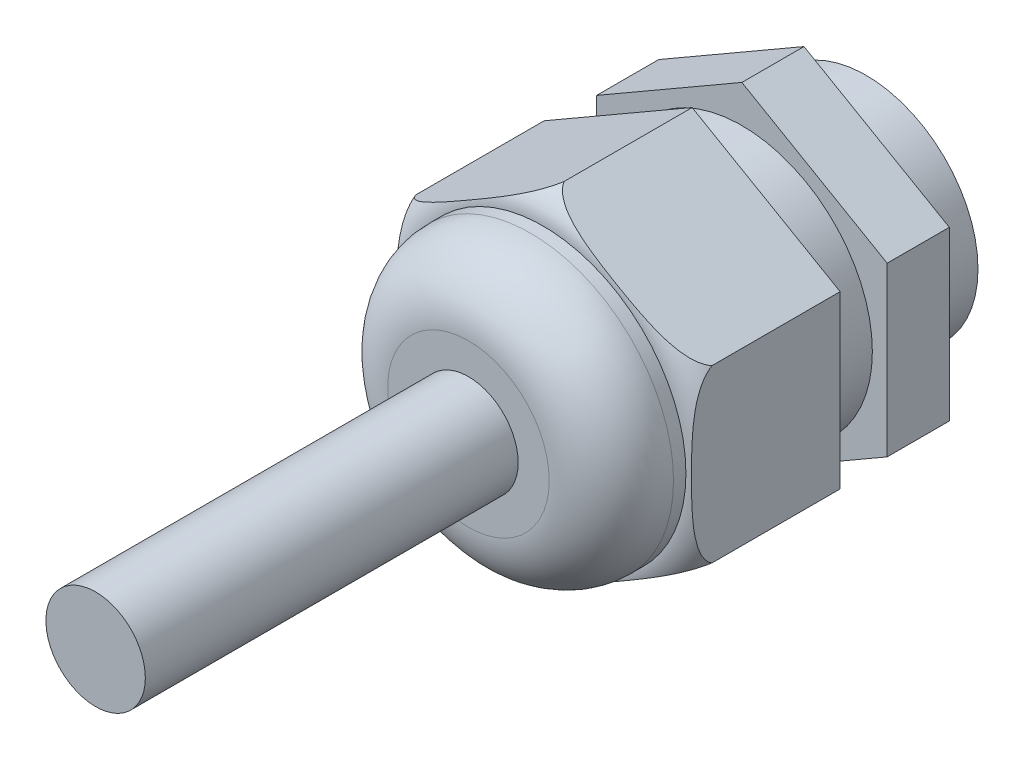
ISO-10303-21;
HEADER;
FILE_DESCRIPTION(('STEP AP214'),'2;1');
FILE_NAME('part.step','',(''),(''),'','','');
FILE_SCHEMA(('AUTOMOTIVE_DESIGN { 1 0 10303 214 1 1 1 1 }'));
ENDSEC;
DATA;
#1=APPLICATION_CONTEXT('core data for automotive mechanical design processes');
#2=APPLICATION_PROTOCOL_DEFINITION('international standard','automotive_design',2000,#1);
#3=PRODUCT_CONTEXT('',#1,'mechanical');
#4=PRODUCT('Part','Part','',(#3));
#5=PRODUCT_RELATED_PRODUCT_CATEGORY('part','',(#4));
#6=PRODUCT_DEFINITION_FORMATION('','',#4);
#7=PRODUCT_DEFINITION_CONTEXT('part definition',#1,'design');
#8=PRODUCT_DEFINITION('design','',#6,#7);
#9=PRODUCT_DEFINITION_SHAPE('','',#8);
#10=(LENGTH_UNIT() NAMED_UNIT(*) SI_UNIT(.MILLI.,.METRE.));
#11=(NAMED_UNIT(*) PLANE_ANGLE_UNIT() SI_UNIT($,.RADIAN.));
#12=(NAMED_UNIT(*) SI_UNIT($,.STERADIAN.) SOLID_ANGLE_UNIT());
#13=UNCERTAINTY_MEASURE_WITH_UNIT(LENGTH_MEASURE(1.E-05),#10,'distance_accuracy_value','');
#14=(GEOMETRIC_REPRESENTATION_CONTEXT(3) GLOBAL_UNCERTAINTY_ASSIGNED_CONTEXT((#13)) GLOBAL_UNIT_ASSIGNED_CONTEXT((#10,
#11,#12)) REPRESENTATION_CONTEXT('',''));
#15=CARTESIAN_POINT('',(0.,0.,0.));
#16=DIRECTION('',(0.,0.,1.));
#17=DIRECTION('',(1.,0.,0.));
#18=AXIS2_PLACEMENT_3D('',#15,#16,#17);
#19=CARTESIAN_POINT('',(0.,0.,32.));
#20=DIRECTION('',(0.,0.,1.));
#21=DIRECTION('',(1.,0.,0.));
#22=AXIS2_PLACEMENT_3D('',#19,#20,#21);
#23=PLANE('',#22);
#24=CARTESIAN_POINT('',(0.,0.,32.));
#25=DIRECTION('',(0.,0.,1.));
#26=DIRECTION('',(1.,0.,0.));
#27=AXIS2_PLACEMENT_3D('',#24,#25,#26);
#28=CIRCLE('',#27,6.5);
#29=CARTESIAN_POINT('',(6.5,0.,32.));
#30=VERTEX_POINT('',#29);
#31=EDGE_CURVE('E53',#30,#30,#28,.T.);
#32=ORIENTED_EDGE('',*,*,#31,.T.);
#33=EDGE_LOOP('',(#32));
#34=FACE_BOUND('',#33,.T.);
#35=CARTESIAN_POINT('',(0.,0.,32.));
#36=DIRECTION('',(0.,0.,1.));
#37=DIRECTION('',(1.,0.,0.));
#38=AXIS2_PLACEMENT_3D('',#35,#36,#37);
#39=CIRCLE('',#38,4.);
#40=CARTESIAN_POINT('',(4.,0.,32.));
#41=VERTEX_POINT('',#40);
#42=EDGE_CURVE('E589',#41,#41,#39,.T.);
#43=ORIENTED_EDGE('',*,*,#42,.F.);
#44=EDGE_LOOP('',(#43));
#45=FACE_BOUND('',#44,.T.);
#46=ADVANCED_FACE('F44',(#34,#45),#23,.T.);
#47=CARTESIAN_POINT('',(-11.6913429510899,20.25,10.));
#48=DIRECTION('',(0.,0.,1.));
#49=DIRECTION('',(1.,0.,0.));
#50=AXIS2_PLACEMENT_3D('',#47,#48,#49);
#51=PLANE('',#50);
#52=DIRECTION('',(-0.866025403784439,0.5,0.));
#53=VECTOR('',#52,1.);
#54=CARTESIAN_POINT('',(11.6913429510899,6.75000000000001,10.));
#55=LINE('',#54,#53);
#56=CARTESIAN_POINT('',(11.6913429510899,6.75000000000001,10.));
#57=VERTEX_POINT('',#56);
#58=CARTESIAN_POINT('',(0.,13.5000000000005,10.));
#59=VERTEX_POINT('',#58);
#60=EDGE_CURVE('E208',#57,#59,#55,.T.);
#61=ORIENTED_EDGE('',*,*,#60,.T.);
#62=DIRECTION('',(-0.866025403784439,-0.5,0.));
#63=VECTOR('',#62,1.);
#64=CARTESIAN_POINT('',(0.,13.5000000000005,10.));
#65=LINE('',#64,#63);
#66=CARTESIAN_POINT('',(-11.6913429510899,6.74999999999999,10.));
#67=VERTEX_POINT('',#66);
#68=EDGE_CURVE('E211',#59,#67,#65,.T.);
#69=ORIENTED_EDGE('',*,*,#68,.T.);
#70=DIRECTION('',(0.,-1.,0.));
#71=VECTOR('',#70,1.);
#72=CARTESIAN_POINT('',(-11.6913429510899,6.74999999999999,10.));
#73=LINE('',#72,#71);
#74=CARTESIAN_POINT('',(-11.6913429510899,-6.75000000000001,10.));
#75=VERTEX_POINT('',#74);
#76=EDGE_CURVE('E214',#67,#75,#73,.T.);
#77=ORIENTED_EDGE('',*,*,#76,.T.);
#78=DIRECTION('',(0.866025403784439,-0.5,0.));
#79=VECTOR('',#78,1.);
#80=CARTESIAN_POINT('',(-11.6913429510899,-6.75000000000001,10.));
#81=LINE('',#80,#79);
#82=CARTESIAN_POINT('',(0.,-13.5,10.));
#83=VERTEX_POINT('',#82);
#84=EDGE_CURVE('E217',#75,#83,#81,.T.);
#85=ORIENTED_EDGE('',*,*,#84,.T.);
#86=DIRECTION('',(0.866025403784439,0.5,0.));
#87=VECTOR('',#86,1.);
#88=CARTESIAN_POINT('',(0.,-13.5,10.));
#89=LINE('',#88,#87);
#90=CARTESIAN_POINT('',(11.6913429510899,-6.74999999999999,10.));
#91=VERTEX_POINT('',#90);
#92=EDGE_CURVE('E220',#83,#91,#89,.T.);
#93=ORIENTED_EDGE('',*,*,#92,.T.);
#94=DIRECTION('',(0.,1.,0.));
#95=VECTOR('',#94,1.);
#96=CARTESIAN_POINT('',(11.6913429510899,-6.74999999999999,10.));
#97=LINE('',#96,#95);
#98=EDGE_CURVE('E68',#91,#57,#97,.T.);
#99=ORIENTED_EDGE('',*,*,#98,.T.);
#100=EDGE_LOOP('',(#61,#69,#77,#85,#93,#99));
#101=FACE_BOUND('',#100,.T.);
#102=CARTESIAN_POINT('',(0.,0.,10.));
#103=DIRECTION('',(0.,0.,1.));
#104=DIRECTION('',(1.,0.,0.));
#105=AXIS2_PLACEMENT_3D('',#102,#103,#104);
#106=CIRCLE('',#105,10.5);
#107=CARTESIAN_POINT('',(10.5,0.,10.));
#108=VERTEX_POINT('',#107);
#109=EDGE_CURVE('E181',#108,#108,#106,.T.);
#110=ORIENTED_EDGE('',*,*,#109,.F.);
#111=EDGE_LOOP('',(#110));
#112=FACE_BOUND('',#111,.T.);
#113=ADVANCED_FACE('F279',(#101,#112),#51,.T.);
#114=CARTESIAN_POINT('',(0.,0.,5.));
#115=DIRECTION('',(0.,0.,-1.));
#116=DIRECTION('',(-1.,0.,0.));
#117=AXIS2_PLACEMENT_3D('',#114,#115,#116);
#118=CYLINDRICAL_SURFACE('',#117,9.);
#119=CARTESIAN_POINT('',(0.,0.,5.));
#120=DIRECTION('',(0.,0.,1.));
#121=DIRECTION('',(1.,0.,0.));
#122=AXIS2_PLACEMENT_3D('',#119,#120,#121);
#123=CIRCLE('',#122,9.);
#124=CARTESIAN_POINT('',(9.,0.,5.));
#125=VERTEX_POINT('',#124);
#126=EDGE_CURVE('E253',#125,#125,#123,.T.);
#127=ORIENTED_EDGE('',*,*,#126,.F.);
#128=EDGE_LOOP('',(#127));
#129=FACE_BOUND('',#128,.T.);
#130=CARTESIAN_POINT('',(0.,0.,0.));
#131=DIRECTION('',(0.,0.,1.));
#132=DIRECTION('',(1.,0.,0.));
#133=AXIS2_PLACEMENT_3D('',#130,#131,#132);
#134=CIRCLE('',#133,9.);
#135=CARTESIAN_POINT('',(9.,0.,0.));
#136=VERTEX_POINT('',#135);
#137=EDGE_CURVE('E249',#136,#136,#134,.T.);
#138=ORIENTED_EDGE('',*,*,#137,.T.);
#139=EDGE_LOOP('',(#138));
#140=FACE_BOUND('',#139,.T.);
#141=ADVANCED_FACE('F46',(#129,#140),#118,.T.);
#142=CARTESIAN_POINT('',(0.,0.,0.));
#143=DIRECTION('',(0.,0.,1.));
#144=DIRECTION('',(1.,0.,0.));
#145=AXIS2_PLACEMENT_3D('',#142,#143,#144);
#146=PLANE('',#145);
#147=ORIENTED_EDGE('',*,*,#137,.F.);
#148=EDGE_LOOP('',(#147));
#149=FACE_BOUND('',#148,.T.);
#150=ADVANCED_FACE('F349',(#149),#146,.F.);
#151=CARTESIAN_POINT('',(-11.69134295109,20.25,5.));
#152=DIRECTION('',(0.,0.,1.));
#153=DIRECTION('',(1.,0.,0.));
#154=AXIS2_PLACEMENT_3D('',#151,#152,#153);
#155=PLANE('',#154);
#156=DIRECTION('',(-0.866025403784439,0.5,0.));
#157=VECTOR('',#156,1.);
#158=CARTESIAN_POINT('',(11.6913429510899,6.75000000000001,5.));
#159=LINE('',#158,#157);
#160=CARTESIAN_POINT('',(11.6913429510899,6.75000000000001,5.));
#161=VERTEX_POINT('',#160);
#162=CARTESIAN_POINT('',(0.,13.5,5.));
#163=VERTEX_POINT('',#162);
#164=EDGE_CURVE('E189',#161,#163,#159,.T.);
#165=ORIENTED_EDGE('',*,*,#164,.F.);
#166=DIRECTION('',(0.,1.,0.));
#167=VECTOR('',#166,1.);
#168=CARTESIAN_POINT('',(11.6913429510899,-6.74999999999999,5.));
#169=LINE('',#168,#167);
#170=CARTESIAN_POINT('',(11.6913429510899,-6.74999999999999,5.));
#171=VERTEX_POINT('',#170);
#172=EDGE_CURVE('E205',#171,#161,#169,.T.);
#173=ORIENTED_EDGE('',*,*,#172,.F.);
#174=DIRECTION('',(0.866025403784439,0.5,0.));
#175=VECTOR('',#174,1.);
#176=CARTESIAN_POINT('',(0.,-13.5,5.));
#177=LINE('',#176,#175);
#178=CARTESIAN_POINT('',(0.,-13.5,5.));
#179=VERTEX_POINT('',#178);
#180=EDGE_CURVE('E202',#179,#171,#177,.T.);
#181=ORIENTED_EDGE('',*,*,#180,.F.);
#182=DIRECTION('',(0.866025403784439,-0.5,0.));
#183=VECTOR('',#182,1.);
#184=CARTESIAN_POINT('',(-11.6913429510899,-6.75000000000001,5.));
#185=LINE('',#184,#183);
#186=CARTESIAN_POINT('',(-11.6913429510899,-6.75000000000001,5.));
#187=VERTEX_POINT('',#186);
#188=EDGE_CURVE('E199',#187,#179,#185,.T.);
#189=ORIENTED_EDGE('',*,*,#188,.F.);
#190=DIRECTION('',(0.,-1.,0.));
#191=VECTOR('',#190,1.);
#192=CARTESIAN_POINT('',(-11.6913429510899,6.74999999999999,5.));
#193=LINE('',#192,#191);
#194=CARTESIAN_POINT('',(-11.6913429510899,6.74999999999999,5.));
#195=VERTEX_POINT('',#194);
#196=EDGE_CURVE('E196',#195,#187,#193,.T.);
#197=ORIENTED_EDGE('',*,*,#196,.F.);
#198=DIRECTION('',(-0.866025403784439,-0.5,0.));
#199=VECTOR('',#198,1.);
#200=CARTESIAN_POINT('',(0.,13.5,5.));
#201=LINE('',#200,#199);
#202=EDGE_CURVE('E193',#163,#195,#201,.T.);
#203=ORIENTED_EDGE('',*,*,#202,.F.);
#204=EDGE_LOOP('',(#165,#173,#181,#189,#197,#203));
#205=FACE_BOUND('',#204,.T.);
#206=ORIENTED_EDGE('',*,*,#126,.T.);
#207=EDGE_LOOP('',(#206));
#208=FACE_BOUND('',#207,.T.);
#209=ADVANCED_FACE('F346',(#205,#208),#155,.F.);
#210=CARTESIAN_POINT('',(11.6913429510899,6.75000000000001,10.));
#211=DIRECTION('',(-0.5,-0.866025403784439,0.));
#212=DIRECTION('',(0.866025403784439,-0.5,0.));
#213=AXIS2_PLACEMENT_3D('',#210,#211,#212);
#214=PLANE('',#213);
#215=ORIENTED_EDGE('',*,*,#164,.T.);
#216=DIRECTION('',(0.,0.,-1.));
#217=VECTOR('',#216,1.);
#218=CARTESIAN_POINT('',(0.,13.5000000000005,10.));
#219=LINE('',#218,#217);
#220=EDGE_CURVE('E245',#59,#163,#219,.T.);
#221=ORIENTED_EDGE('',*,*,#220,.F.);
#222=ORIENTED_EDGE('',*,*,#60,.F.);
#223=DIRECTION('',(0.,0.,-1.));
#224=VECTOR('',#223,1.);
#225=CARTESIAN_POINT('',(11.6913429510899,6.75000000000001,10.));
#226=LINE('',#225,#224);
#227=EDGE_CURVE('E225',#57,#161,#226,.T.);
#228=ORIENTED_EDGE('',*,*,#227,.T.);
#229=EDGE_LOOP('',(#215,#221,#222,#228));
#230=FACE_BOUND('',#229,.T.);
#231=ADVANCED_FACE('F348',(#230),#214,.F.);
#232=CARTESIAN_POINT('',(0.,13.5000000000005,10.));
#233=DIRECTION('',(0.5,-0.866025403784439,0.));
#234=DIRECTION('',(0.866025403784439,0.5,0.));
#235=AXIS2_PLACEMENT_3D('',#232,#233,#234);
#236=PLANE('',#235);
#237=ORIENTED_EDGE('',*,*,#202,.T.);
#238=DIRECTION('',(0.,0.,-1.));
#239=VECTOR('',#238,1.);
#240=CARTESIAN_POINT('',(-11.6913429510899,6.74999999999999,10.));
#241=LINE('',#240,#239);
#242=EDGE_CURVE('E241',#67,#195,#241,.T.);
#243=ORIENTED_EDGE('',*,*,#242,.F.);
#244=ORIENTED_EDGE('',*,*,#68,.F.);
#245=ORIENTED_EDGE('',*,*,#220,.T.);
#246=EDGE_LOOP('',(#237,#243,#244,#245));
#247=FACE_BOUND('',#246,.T.);
#248=ADVANCED_FACE('F366',(#247),#236,.F.);
#249=CARTESIAN_POINT('',(-11.6913429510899,6.74999999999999,10.));
#250=DIRECTION('',(1.,0.,0.));
#251=DIRECTION('',(0.,0.,-1.));
#252=AXIS2_PLACEMENT_3D('',#249,#250,#251);
#253=PLANE('',#252);
#254=ORIENTED_EDGE('',*,*,#196,.T.);
#255=DIRECTION('',(0.,0.,-1.));
#256=VECTOR('',#255,1.);
#257=CARTESIAN_POINT('',(-11.6913429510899,-6.75000000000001,10.));
#258=LINE('',#257,#256);
#259=EDGE_CURVE('E237',#75,#187,#258,.T.);
#260=ORIENTED_EDGE('',*,*,#259,.F.);
#261=ORIENTED_EDGE('',*,*,#76,.F.);
#262=ORIENTED_EDGE('',*,*,#242,.T.);
#263=EDGE_LOOP('',(#254,#260,#261,#262));
#264=FACE_BOUND('',#263,.T.);
#265=ADVANCED_FACE('F362',(#264),#253,.F.);
#266=CARTESIAN_POINT('',(-11.6913429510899,-6.75000000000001,10.));
#267=DIRECTION('',(0.5,0.866025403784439,0.));
#268=DIRECTION('',(-0.866025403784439,0.5,0.));
#269=AXIS2_PLACEMENT_3D('',#266,#267,#268);
#270=PLANE('',#269);
#271=ORIENTED_EDGE('',*,*,#188,.T.);
#272=DIRECTION('',(0.,0.,-1.));
#273=VECTOR('',#272,1.);
#274=CARTESIAN_POINT('',(0.,-13.5,10.));
#275=LINE('',#274,#273);
#276=EDGE_CURVE('E233',#83,#179,#275,.T.);
#277=ORIENTED_EDGE('',*,*,#276,.F.);
#278=ORIENTED_EDGE('',*,*,#84,.F.);
#279=ORIENTED_EDGE('',*,*,#259,.T.);
#280=EDGE_LOOP('',(#271,#277,#278,#279));
#281=FACE_BOUND('',#280,.T.);
#282=ADVANCED_FACE('F358',(#281),#270,.F.);
#283=CARTESIAN_POINT('',(0.,-13.5,10.));
#284=DIRECTION('',(-0.5,0.866025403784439,0.));
#285=DIRECTION('',(-0.866025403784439,-0.5,0.));
#286=AXIS2_PLACEMENT_3D('',#283,#284,#285);
#287=PLANE('',#286);
#288=ORIENTED_EDGE('',*,*,#180,.T.);
#289=DIRECTION('',(0.,0.,-1.));
#290=VECTOR('',#289,1.);
#291=CARTESIAN_POINT('',(11.6913429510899,-6.74999999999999,10.));
#292=LINE('',#291,#290);
#293=EDGE_CURVE('E229',#91,#171,#292,.T.);
#294=ORIENTED_EDGE('',*,*,#293,.F.);
#295=ORIENTED_EDGE('',*,*,#92,.F.);
#296=ORIENTED_EDGE('',*,*,#276,.T.);
#297=EDGE_LOOP('',(#288,#294,#295,#296));
#298=FACE_BOUND('',#297,.T.);
#299=ADVANCED_FACE('F354',(#298),#287,.F.);
#300=CARTESIAN_POINT('',(11.6913429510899,-6.74999999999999,10.));
#301=DIRECTION('',(-1.,0.,0.));
#302=DIRECTION('',(0.,0.,1.));
#303=AXIS2_PLACEMENT_3D('',#300,#301,#302);
#304=PLANE('',#303);
#305=ORIENTED_EDGE('',*,*,#172,.T.);
#306=ORIENTED_EDGE('',*,*,#227,.F.);
#307=ORIENTED_EDGE('',*,*,#98,.F.);
#308=ORIENTED_EDGE('',*,*,#293,.T.);
#309=EDGE_LOOP('',(#305,#306,#307,#308));
#310=FACE_BOUND('',#309,.T.);
#311=ADVANCED_FACE('F344',(#310),#304,.F.);
#312=CARTESIAN_POINT('',(0.,0.,14.));
#313=DIRECTION('',(0.,0.,-1.));
#314=DIRECTION('',(-1.,0.,0.));
#315=AXIS2_PLACEMENT_3D('',#312,#313,#314);
#316=CYLINDRICAL_SURFACE('',#315,10.5);
#317=CARTESIAN_POINT('',(0.,0.,14.));
#318=DIRECTION('',(0.,0.,1.));
#319=DIRECTION('',(1.,0.,0.));
#320=AXIS2_PLACEMENT_3D('',#317,#318,#319);
#321=CIRCLE('',#320,10.5);
#322=CARTESIAN_POINT('',(10.5,0.,14.));
#323=VERTEX_POINT('',#322);
#324=EDGE_CURVE('E185',#323,#323,#321,.T.);
#325=ORIENTED_EDGE('',*,*,#324,.F.);
#326=EDGE_LOOP('',(#325));
#327=FACE_BOUND('',#326,.T.);
#328=ORIENTED_EDGE('',*,*,#109,.T.);
#329=EDGE_LOOP('',(#328));
#330=FACE_BOUND('',#329,.T.);
#331=ADVANCED_FACE('F288',(#327,#330),#316,.T.);
#332=CARTESIAN_POINT('',(11.907849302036,6.87500000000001,14.));
#333=DIRECTION('',(0.,0.,-1.));
#334=DIRECTION('',(-1.,0.,0.));
#335=AXIS2_PLACEMENT_3D('',#332,#333,#334);
#336=PLANE('',#335);
#337=DIRECTION('',(-0.866025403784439,0.5,0.));
#338=VECTOR('',#337,1.);
#339=CARTESIAN_POINT('',(11.907849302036,6.87500000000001,14.));
#340=LINE('',#339,#338);
#341=CARTESIAN_POINT('',(11.907849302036,6.87500000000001,14.));
#342=VERTEX_POINT('',#341);
#343=CARTESIAN_POINT('',(0.,13.7500000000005,14.));
#344=VERTEX_POINT('',#343);
#345=EDGE_CURVE('E151',#342,#344,#340,.T.);
#346=ORIENTED_EDGE('',*,*,#345,.F.);
#347=DIRECTION('',(0.,1.,0.));
#348=VECTOR('',#347,1.);
#349=CARTESIAN_POINT('',(11.907849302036,-6.87499999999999,14.));
#350=LINE('',#349,#348);
#351=CARTESIAN_POINT('',(11.907849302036,-6.87499999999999,14.));
#352=VERTEX_POINT('',#351);
#353=EDGE_CURVE('E156',#352,#342,#350,.T.);
#354=ORIENTED_EDGE('',*,*,#353,.F.);
#355=DIRECTION('',(0.866025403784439,0.5,0.));
#356=VECTOR('',#355,1.);
#357=CARTESIAN_POINT('',(0.,-13.75,14.));
#358=LINE('',#357,#356);
#359=CARTESIAN_POINT('',(0.,-13.75,14.));
#360=VERTEX_POINT('',#359);
#361=EDGE_CURVE('E167',#360,#352,#358,.T.);
#362=ORIENTED_EDGE('',*,*,#361,.F.);
#363=DIRECTION('',(0.866025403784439,-0.5,0.));
#364=VECTOR('',#363,1.);
#365=CARTESIAN_POINT('',(-11.907849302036,-6.87500000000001,14.));
#366=LINE('',#365,#364);
#367=CARTESIAN_POINT('',(-11.907849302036,-6.87500000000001,14.));
#368=VERTEX_POINT('',#367);
#369=EDGE_CURVE('E570',#368,#360,#366,.T.);
#370=ORIENTED_EDGE('',*,*,#369,.F.);
#371=DIRECTION('',(0.,-1.,0.));
#372=VECTOR('',#371,1.);
#373=CARTESIAN_POINT('',(-11.907849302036,6.87499999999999,14.));
#374=LINE('',#373,#372);
#375=CARTESIAN_POINT('',(-11.907849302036,6.87499999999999,14.));
#376=VERTEX_POINT('',#375);
#377=EDGE_CURVE('E565',#376,#368,#374,.T.);
#378=ORIENTED_EDGE('',*,*,#377,.F.);
#379=DIRECTION('',(-0.866025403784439,-0.5,0.));
#380=VECTOR('',#379,1.);
#381=CARTESIAN_POINT('',(0.,13.7500000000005,14.));
#382=LINE('',#381,#380);
#383=EDGE_CURVE('E578',#344,#376,#382,.T.);
#384=ORIENTED_EDGE('',*,*,#383,.F.);
#385=EDGE_LOOP('',(#346,#354,#362,#370,#378,#384));
#386=FACE_BOUND('',#385,.T.);
#387=ORIENTED_EDGE('',*,*,#324,.T.);
#388=EDGE_LOOP('',(#387));
#389=FACE_BOUND('',#388,.T.);
#390=ADVANCED_FACE('F285',(#386,#389),#336,.T.);
#391=CARTESIAN_POINT('',(11.907849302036,6.87500000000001,26.));
#392=DIRECTION('',(-0.5,-0.866025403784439,0.));
#393=DIRECTION('',(0.866025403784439,-0.5,0.));
#394=AXIS2_PLACEMENT_3D('',#391,#392,#393);
#395=PLANE('',#394);
#396=DIRECTION('',(0.,0.,-1.));
#397=VECTOR('',#396,1.);
#398=CARTESIAN_POINT('',(0.,13.7500000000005,26.));
#399=LINE('',#398,#397);
#400=CARTESIAN_POINT('',(1.33226762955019E-12,13.7500000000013,24.3087850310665));
#401=VERTEX_POINT('',#400);
#402=EDGE_CURVE('E149',#401,#344,#399,.T.);
#403=ORIENTED_EDGE('',*,*,#402,.F.);
#404=CARTESIAN_POINT('',(-0.000200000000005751,13.7501154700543,24.3083858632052));
#405=CARTESIAN_POINT('',(0.0280782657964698,13.7337890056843,24.3648309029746));
#406=CARTESIAN_POINT('',(0.0593798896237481,13.7157170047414,24.4190860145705));
#407=CARTESIAN_POINT('',(0.12688702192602,13.6767417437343,24.5230816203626));
#408=CARTESIAN_POINT('',(0.163074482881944,13.6558489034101,24.5728376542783));
#409=CARTESIAN_POINT('',(0.276261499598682,13.5905003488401,24.714062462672));
#410=CARTESIAN_POINT('',(0.358952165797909,13.5427588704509,24.7994613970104));
#411=CARTESIAN_POINT('',(0.510334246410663,13.4553583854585,24.9344636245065));
#412=CARTESIAN_POINT('',(0.576823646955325,13.4169707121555,24.9875216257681));
#413=CARTESIAN_POINT('',(0.713592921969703,13.3380069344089,25.0867156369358));
#414=CARTESIAN_POINT('',(0.783873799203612,13.2974302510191,25.1328498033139));
#415=CARTESIAN_POINT('',(0.927811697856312,13.2143276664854,25.2193876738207));
#416=CARTESIAN_POINT('',(1.00149365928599,13.1717873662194,25.259735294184));
#417=CARTESIAN_POINT('',(1.15088584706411,13.0855357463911,25.3349772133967));
#418=CARTESIAN_POINT('',(1.22659576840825,13.0418246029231,25.3698723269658));
#419=CARTESIAN_POINT('',(1.40518426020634,12.9387164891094,25.4458167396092));
#420=CARTESIAN_POINT('',(1.50865489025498,12.8789776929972,25.4850021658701));
#421=CARTESIAN_POINT('',(1.71743212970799,12.758440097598,25.5562813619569));
#422=CARTESIAN_POINT('',(1.8227395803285,12.6976408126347,25.588371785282));
#423=CARTESIAN_POINT('',(2.03473939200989,12.5752426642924,25.6466359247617));
#424=CARTESIAN_POINT('',(2.14143370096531,12.513642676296,25.6728000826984));
#425=CARTESIAN_POINT('',(2.35566110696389,12.3899584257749,25.7201099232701));
#426=CARTESIAN_POINT('',(2.46319435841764,12.3278740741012,25.7412546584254));
#427=CARTESIAN_POINT('',(2.78713150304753,12.1408488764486,25.7985060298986));
#428=CARTESIAN_POINT('',(3.00436882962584,12.0154268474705,25.8283002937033));
#429=CARTESIAN_POINT('',(3.43952370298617,11.764190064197,25.8762812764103));
#430=CARTESIAN_POINT('',(3.65744050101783,11.6383757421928,25.8944779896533));
#431=CARTESIAN_POINT('',(4.1211864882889,11.3706318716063,25.9249058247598));
#432=CARTESIAN_POINT('',(4.36706439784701,11.2286741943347,25.9360930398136));
#433=CARTESIAN_POINT('',(4.85900485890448,10.9446522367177,25.9523657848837));
#434=CARTESIAN_POINT('',(5.10506743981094,10.802587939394,25.9574499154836));
#435=CARTESIAN_POINT('',(5.59638708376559,10.5189244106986,25.9636045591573));
#436=CARTESIAN_POINT('',(5.84164403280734,10.3773252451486,25.9646886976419));
#437=CARTESIAN_POINT('',(6.33212846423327,10.0941439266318,25.9633985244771));
#438=CARTESIAN_POINT('',(6.57735594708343,9.95256177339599,25.9610245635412));
#439=CARTESIAN_POINT('',(6.98677908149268,9.71618121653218,25.9532422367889));
#440=CARTESIAN_POINT('',(7.15099194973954,9.62137287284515,25.949094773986));
#441=CARTESIAN_POINT('',(7.47934517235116,9.43179805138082,25.9380029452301));
#442=CARTESIAN_POINT('',(7.6434855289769,9.33703157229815,25.9310586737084));
#443=CARTESIAN_POINT('',(7.97214593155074,9.14727940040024,25.9133084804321));
#444=CARTESIAN_POINT('',(8.13666549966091,9.05229398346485,25.9024902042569));
#445=CARTESIAN_POINT('',(8.46537750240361,8.86251202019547,25.8755988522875));
#446=CARTESIAN_POINT('',(8.62956996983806,8.7677154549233,25.8595263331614));
#447=CARTESIAN_POINT('',(8.95887945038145,8.57758853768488,25.8201621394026));
#448=CARTESIAN_POINT('',(9.12399073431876,8.48226149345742,25.7968043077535));
#449=CARTESIAN_POINT('',(9.45312703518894,8.29223456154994,25.7405903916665));
#450=CARTESIAN_POINT('',(9.61715143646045,8.19753502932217,25.7077293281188));
#451=CARTESIAN_POINT('',(9.94228818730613,8.00981723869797,25.629735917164));
#452=CARTESIAN_POINT('',(10.1034102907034,7.91679334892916,25.5846592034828));
#453=CARTESIAN_POINT('',(10.4215581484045,7.73311059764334,25.4784489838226));
#454=CARTESIAN_POINT('',(10.5785894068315,7.64244855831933,25.4173384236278));
#455=CARTESIAN_POINT('',(10.851687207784,7.4847754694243,25.2897960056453));
#456=CARTESIAN_POINT('',(10.9691758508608,7.41694336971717,25.2274809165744));
#457=CARTESIAN_POINT('',(11.197090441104,7.28535681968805,25.0868433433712));
#458=CARTESIAN_POINT('',(11.3075125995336,7.22160455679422,25.0085123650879));
#459=CARTESIAN_POINT('',(11.4919379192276,7.11512654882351,24.8528866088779));
#460=CARTESIAN_POINT('',(11.5684409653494,7.07095749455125,24.7795816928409));
#461=CARTESIAN_POINT('',(11.7104485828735,6.98896935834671,24.6201562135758));
#462=CARTESIAN_POINT('',(11.7760042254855,6.9511207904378,24.534098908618));
#463=CARTESIAN_POINT('',(11.860179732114,6.90252203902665,24.3985298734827));
#464=CARTESIAN_POINT('',(11.8851189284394,6.8881233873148,24.354164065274));
#465=CARTESIAN_POINT('',(11.9080493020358,6.87488452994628,24.3083858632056));
#466=B_SPLINE_CURVE_WITH_KNOTS('',3,(#404,#405,#406,#407,#408,#409,#410,#411,#412,#413,#414,
#415,#416,#417,#418,#419,#420,#421,#422,#423,#424,#425,#426,#427,#428,#429,#430,#431,#432,#433,
#434,#435,#436,#437,#438,#439,#440,#441,#442,#443,#444,#445,#446,#447,#448,#449,#450,#451,#452,
#453,#454,#455,#456,#457,#458,#459,#460,#461,#462,#463,#464,#465),.UNSPECIFIED.,.F.,.F.,(4,2,2,
2,2,2,2,2,2,2,2,2,2,2,2,2,2,2,2,2,2,2,2,2,2,2,2,2,2,2,4),(0.,0.195271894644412,
0.389841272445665,0.772129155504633,1.05177957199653,1.33150431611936,1.61377950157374,
1.89601246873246,2.27294766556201,2.65006027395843,3.02777684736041,3.40556466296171,
4.16292456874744,4.91963092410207,5.77192249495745,6.62440945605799,7.47398984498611,
8.32348407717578,8.89245598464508,9.46140868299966,10.0321922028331,10.6029152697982,
11.1789797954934,11.7553466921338,12.3291315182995,12.9020996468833,13.3492224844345,
13.7965830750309,14.1399765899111,14.481720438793,14.6402256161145),.UNSPECIFIED.);
#467=CARTESIAN_POINT('',(11.907849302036,6.87500000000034,24.3087850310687));
#468=VERTEX_POINT('',#467);
#469=EDGE_CURVE('E135',#401,#468,#466,.T.);
#470=ORIENTED_EDGE('',*,*,#469,.T.);
#471=DIRECTION('',(0.,0.,-1.));
#472=VECTOR('',#471,1.);
#473=CARTESIAN_POINT('',(11.907849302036,6.87500000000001,26.));
#474=LINE('',#473,#472);
#475=EDGE_CURVE('E147',#468,#342,#474,.T.);
#476=ORIENTED_EDGE('',*,*,#475,.T.);
#477=ORIENTED_EDGE('',*,*,#345,.T.);
#478=EDGE_LOOP('',(#403,#470,#476,#477));
#479=FACE_BOUND('',#478,.T.);
#480=ADVANCED_FACE('F145',(#479),#395,.F.);
#481=CARTESIAN_POINT('',(0.,13.7500000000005,26.));
#482=DIRECTION('',(0.5,-0.866025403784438,0.));
#483=DIRECTION('',(0.866025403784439,0.5,0.));
#484=AXIS2_PLACEMENT_3D('',#481,#482,#483);
#485=PLANE('',#484);
#486=DIRECTION('',(0.,0.,-1.));
#487=VECTOR('',#486,1.);
#488=CARTESIAN_POINT('',(-11.907849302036,6.87500000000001,26.));
#489=LINE('',#488,#487);
#490=CARTESIAN_POINT('',(-11.907849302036,6.87499999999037,24.3087850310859));
#491=VERTEX_POINT('',#490);
#492=EDGE_CURVE('E176',#491,#376,#489,.T.);
#493=ORIENTED_EDGE('',*,*,#492,.F.);
#494=CARTESIAN_POINT('',(-11.9080493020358,6.87488452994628,24.3083858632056));
#495=CARTESIAN_POINT('',(-11.8797710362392,6.89121099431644,24.3648309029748));
#496=CARTESIAN_POINT('',(-11.8484694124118,6.90928299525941,24.4190860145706));
#497=CARTESIAN_POINT('',(-11.7809622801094,6.94825825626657,24.5230816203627));
#498=CARTESIAN_POINT('',(-11.7447748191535,6.96915109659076,24.5728376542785));
#499=CARTESIAN_POINT('',(-11.6315878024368,7.0344996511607,24.7140624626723));
#500=CARTESIAN_POINT('',(-11.5488971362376,7.08224112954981,24.7994613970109));
#501=CARTESIAN_POINT('',(-11.3975150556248,7.16964161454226,24.9344636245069));
#502=CARTESIAN_POINT('',(-11.33102565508,7.20802928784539,24.9875216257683));
#503=CARTESIAN_POINT('',(-11.1942563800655,7.28699306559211,25.0867156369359));
#504=CARTESIAN_POINT('',(-11.1239755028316,7.32756974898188,25.1328498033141));
#505=CARTESIAN_POINT('',(-10.9800376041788,7.41067233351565,25.2193876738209));
#506=CARTESIAN_POINT('',(-10.9063556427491,7.45321263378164,25.2597352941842));
#507=CARTESIAN_POINT('',(-10.7569634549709,7.53946425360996,25.334977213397));
#508=CARTESIAN_POINT('',(-10.6812535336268,7.58317539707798,25.3698723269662));
#509=CARTESIAN_POINT('',(-10.5026650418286,7.68628351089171,25.4458167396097));
#510=CARTESIAN_POINT('',(-10.3991944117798,7.74602230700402,25.4850021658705));
#511=CARTESIAN_POINT('',(-10.1904171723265,7.86655990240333,25.5562813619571));
#512=CARTESIAN_POINT('',(-10.0851097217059,7.92735918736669,25.5883717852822));
#513=CARTESIAN_POINT('',(-9.87310991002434,8.04975733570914,25.646635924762));
#514=CARTESIAN_POINT('',(-9.7664156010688,8.11135732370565,25.6728000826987));
#515=CARTESIAN_POINT('',(-9.55218819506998,8.23504157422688,25.7201099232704));
#516=CARTESIAN_POINT('',(-9.44465494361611,8.29712592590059,25.7412546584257));
#517=CARTESIAN_POINT('',(-9.12071779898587,8.48415112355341,25.7985060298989));
#518=CARTESIAN_POINT('',(-8.90348047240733,8.60957315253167,25.8283002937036));
#519=CARTESIAN_POINT('',(-8.46832559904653,8.86080993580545,25.8762812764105));
#520=CARTESIAN_POINT('',(-8.25040880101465,8.98662425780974,25.8944779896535));
#521=CARTESIAN_POINT('',(-7.78666281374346,9.25436812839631,25.92490582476));
#522=CARTESIAN_POINT('',(-7.54078490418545,9.39632580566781,25.9360930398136));
#523=CARTESIAN_POINT('',(-7.04884444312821,9.68034776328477,25.9523657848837));
#524=CARTESIAN_POINT('',(-6.80278186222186,9.82241206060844,25.9574499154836));
#525=CARTESIAN_POINT('',(-6.31146221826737,10.1060755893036,25.9636045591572));
#526=CARTESIAN_POINT('',(-6.06620526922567,10.2476747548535,25.9646886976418));
#527=CARTESIAN_POINT('',(-5.57572083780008,10.5308560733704,25.9633985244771));
#528=CARTESIAN_POINT('',(-5.33049335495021,10.6724382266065,25.9610245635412));
#529=CARTESIAN_POINT('',(-4.9210702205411,10.90881878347,25.9532422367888));
#530=CARTESIAN_POINT('',(-4.75685735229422,11.0036271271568,25.9490947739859));
#531=CARTESIAN_POINT('',(-4.42850412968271,11.1932019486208,25.9380029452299));
#532=CARTESIAN_POINT('',(-4.26436377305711,11.2879684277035,25.9310586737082));
#533=CARTESIAN_POINT('',(-3.93570337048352,11.4777205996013,25.9133084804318));
#534=CARTESIAN_POINT('',(-3.77118380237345,11.5727060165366,25.9024902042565));
#535=CARTESIAN_POINT('',(-3.44247179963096,11.7624879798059,25.8755988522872));
#536=CARTESIAN_POINT('',(-3.27827933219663,11.857284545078,25.8595263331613));
#537=CARTESIAN_POINT('',(-2.94896985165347,12.0474114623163,25.8201621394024));
#538=CARTESIAN_POINT('',(-2.78385856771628,12.1427385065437,25.7968043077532));
#539=CARTESIAN_POINT('',(-2.45472226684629,12.332765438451,25.7405903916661));
#540=CARTESIAN_POINT('',(-2.29069786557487,12.4274649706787,25.7077293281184));
#541=CARTESIAN_POINT('',(-1.96556111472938,12.6151827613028,25.6297359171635));
#542=CARTESIAN_POINT('',(-1.80443901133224,12.7082066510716,25.5846592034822));
#543=CARTESIAN_POINT('',(-1.48629115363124,12.8918894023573,25.4784489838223));
#544=CARTESIAN_POINT('',(-1.32925989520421,12.9825514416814,25.4173384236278));
#545=CARTESIAN_POINT('',(-1.05616209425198,13.1402245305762,25.2897960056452));
#546=CARTESIAN_POINT('',(-0.938673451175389,13.2080566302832,25.2274809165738));
#547=CARTESIAN_POINT('',(-0.710758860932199,13.3396431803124,25.0868433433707));
#548=CARTESIAN_POINT('',(-0.600336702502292,13.4033954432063,25.008512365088));
#549=CARTESIAN_POINT('',(-0.415911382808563,13.5098734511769,24.8528866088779));
#550=CARTESIAN_POINT('',(-0.339408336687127,13.554042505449,24.7795816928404));
#551=CARTESIAN_POINT('',(-0.197400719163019,13.6360306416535,24.6201562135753));
#552=CARTESIAN_POINT('',(-0.131845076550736,13.6738792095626,24.5340989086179));
#553=CARTESIAN_POINT('',(-0.0476695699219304,13.7224779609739,24.3985298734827));
#554=CARTESIAN_POINT('',(-0.0227303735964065,13.7368766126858,24.3541640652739));
#555=CARTESIAN_POINT('',(0.000200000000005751,13.7501154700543,24.3083858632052));
#556=B_SPLINE_CURVE_WITH_KNOTS('',3,(#494,#495,#496,#497,#498,#499,#500,#501,#502,#503,#504,
#505,#506,#507,#508,#509,#510,#511,#512,#513,#514,#515,#516,#517,#518,#519,#520,#521,#522,#523,
#524,#525,#526,#527,#528,#529,#530,#531,#532,#533,#534,#535,#536,#537,#538,#539,#540,#541,#542,
#543,#544,#545,#546,#547,#548,#549,#550,#551,#552,#553,#554,#555),.UNSPECIFIED.,.F.,.F.,(4,2,2,
2,2,2,2,2,2,2,2,2,2,2,2,2,2,2,2,2,2,2,2,2,2,2,2,2,2,2,4),(0.,0.195271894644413,0.38984127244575,
0.772129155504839,1.05177957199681,1.33150431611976,1.61377950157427,1.89601246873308,
2.27294766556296,2.65006027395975,3.02777684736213,3.40556466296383,4.16292456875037,
4.91963092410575,5.77192249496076,6.62440945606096,7.47398984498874,8.32348407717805,
8.89245598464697,9.46140868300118,10.0321922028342,10.6029152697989,11.1789797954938,
11.7553466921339,12.3291315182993,12.9020996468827,13.3492224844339,13.7965830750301,
14.1399765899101,14.4817204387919,14.640225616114),.UNSPECIFIED.);
#557=EDGE_CURVE('E152',#491,#401,#556,.T.);
#558=ORIENTED_EDGE('',*,*,#557,.T.);
#559=ORIENTED_EDGE('',*,*,#402,.T.);
#560=ORIENTED_EDGE('',*,*,#383,.T.);
#561=EDGE_LOOP('',(#493,#558,#559,#560));
#562=FACE_BOUND('',#561,.T.);
#563=ADVANCED_FACE('F333',(#562),#485,.F.);
#564=CARTESIAN_POINT('',(-11.907849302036,6.87500000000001,26.));
#565=DIRECTION('',(1.,0.,0.));
#566=DIRECTION('',(0.,0.,-1.));
#567=AXIS2_PLACEMENT_3D('',#564,#565,#566);
#568=PLANE('',#567);
#569=DIRECTION('',(0.,0.,-1.));
#570=VECTOR('',#569,1.);
#571=CARTESIAN_POINT('',(-11.907849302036,-6.87499999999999,26.));
#572=LINE('',#571,#570);
#573=CARTESIAN_POINT('',(-11.9078493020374,-6.8749999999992,24.3087850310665));
#574=VERTEX_POINT('',#573);
#575=EDGE_CURVE('E173',#574,#368,#572,.T.);
#576=ORIENTED_EDGE('',*,*,#575,.F.);
#577=CARTESIAN_POINT('',(-11.907849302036,0.,25.9642188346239));
#578=CARTESIAN_POINT('',(-11.907849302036,0.196592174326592,25.964217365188));
#579=CARTESIAN_POINT('',(-11.907849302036,0.393184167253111,25.9633729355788));
#580=CARTESIAN_POINT('',(-11.907849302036,0.786356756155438,25.9598075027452));
#581=CARTESIAN_POINT('',(-11.907849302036,0.982937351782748,25.9570864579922));
#582=CARTESIAN_POINT('',(-11.907849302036,1.3762914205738,25.9492130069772));
#583=CARTESIAN_POINT('',(-11.907849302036,1.57306483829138,25.9440576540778));
#584=CARTESIAN_POINT('',(-11.907849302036,1.96649228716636,25.9303912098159));
#585=CARTESIAN_POINT('',(-11.907849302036,2.16314632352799,25.9218802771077));
#586=CARTESIAN_POINT('',(-11.907849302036,2.555238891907,25.9002541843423));
#587=CARTESIAN_POINT('',(-11.907849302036,2.75067863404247,25.8871619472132));
#588=CARTESIAN_POINT('',(-11.907849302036,3.14110144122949,25.8546780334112));
#589=CARTESIAN_POINT('',(-11.907849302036,3.33608439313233,25.8352849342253));
#590=CARTESIAN_POINT('',(-11.907849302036,3.72459879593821,25.7881046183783));
#591=CARTESIAN_POINT('',(-11.907849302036,3.91813256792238,25.7603370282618));
#592=CARTESIAN_POINT('',(-11.907849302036,4.30324554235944,25.6936985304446));
#593=CARTESIAN_POINT('',(-11.907849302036,4.49482592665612,25.6548348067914));
#594=CARTESIAN_POINT('',(-11.907849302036,4.7796518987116,25.5855472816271));
#595=CARTESIAN_POINT('',(-11.907849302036,4.87423220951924,25.5605990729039));
#596=CARTESIAN_POINT('',(-11.907849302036,5.06221337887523,25.5064753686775));
#597=CARTESIAN_POINT('',(-11.907849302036,5.15561393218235,25.4772988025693));
#598=CARTESIAN_POINT('',(-11.907849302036,5.34082497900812,25.4140888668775));
#599=CARTESIAN_POINT('',(-11.907849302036,5.43263468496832,25.3800531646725));
#600=CARTESIAN_POINT('',(-11.907849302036,5.61397531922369,25.3064213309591));
#601=CARTESIAN_POINT('',(-11.907849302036,5.7035068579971,25.2668267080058));
#602=CARTESIAN_POINT('',(-11.907849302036,5.92649131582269,25.1584090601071));
#603=CARTESIAN_POINT('',(-11.907849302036,6.05789936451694,25.0852607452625));
#604=CARTESIAN_POINT('',(-11.907849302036,6.30867283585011,24.9204945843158));
#605=CARTESIAN_POINT('',(-11.907849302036,6.42806676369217,24.8289220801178));
#606=CARTESIAN_POINT('',(-11.907849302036,6.60359961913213,24.6641596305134));
#607=CARTESIAN_POINT('',(-11.907849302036,6.66617127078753,24.597864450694));
#608=CARTESIAN_POINT('',(-11.907849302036,6.78090932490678,24.4567532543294));
#609=CARTESIAN_POINT('',(-11.907849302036,6.83308938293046,24.381948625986));
#610=CARTESIAN_POINT('',(-11.907849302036,6.91541133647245,24.2382944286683));
#611=CARTESIAN_POINT('',(-11.907849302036,6.94782323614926,24.1707578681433));
#612=CARTESIAN_POINT('',(-11.907849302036,7.001025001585,24.0312216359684));
#613=CARTESIAN_POINT('',(-11.907849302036,7.02182389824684,23.9592254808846));
#614=CARTESIAN_POINT('',(-11.907849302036,7.0501245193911,23.8121439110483));
#615=CARTESIAN_POINT('',(-11.907849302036,7.05754215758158,23.7370419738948));
#616=CARTESIAN_POINT('',(-11.907849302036,7.05807131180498,23.5867892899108));
#617=CARTESIAN_POINT('',(-11.907849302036,7.0511845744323,23.5116385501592));
#618=CARTESIAN_POINT('',(-11.907849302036,7.02517161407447,23.3712250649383));
#619=CARTESIAN_POINT('',(-11.907849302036,7.00732046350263,23.3057184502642));
#620=CARTESIAN_POINT('',(-11.907849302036,6.96187805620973,23.1782179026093));
#621=CARTESIAN_POINT('',(-11.907849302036,6.93428419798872,23.1162249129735));
#622=CARTESIAN_POINT('',(-11.907849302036,6.85742863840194,22.971115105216));
#623=CARTESIAN_POINT('',(-11.907849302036,6.80394344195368,22.8902391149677));
#624=CARTESIAN_POINT('',(-11.907849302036,6.68475347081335,22.7380286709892));
#625=CARTESIAN_POINT('',(-11.907849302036,6.619016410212,22.6667203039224));
#626=CARTESIAN_POINT('',(-11.907849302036,6.43915480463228,22.49544029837));
#627=CARTESIAN_POINT('',(-11.907849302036,6.31872733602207,22.4021395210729));
#628=CARTESIAN_POINT('',(-11.907849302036,6.06562641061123,22.2345804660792));
#629=CARTESIAN_POINT('',(-11.907849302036,5.93293872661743,22.1603446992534));
#630=CARTESIAN_POINT('',(-11.907849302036,5.66528980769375,22.0297410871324));
#631=CARTESIAN_POINT('',(-11.907849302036,5.53059770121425,21.972810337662));
#632=CARTESIAN_POINT('',(-11.907849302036,5.25683127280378,21.8704936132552));
#633=CARTESIAN_POINT('',(-11.907849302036,5.11775253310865,21.8251197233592));
#634=CARTESIAN_POINT('',(-11.907849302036,4.83615899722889,21.7435978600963));
#635=CARTESIAN_POINT('',(-11.907849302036,4.69362988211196,21.7075001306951));
#636=CARTESIAN_POINT('',(-11.907849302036,4.47861807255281,21.659202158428));
#637=CARTESIAN_POINT('',(-11.907849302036,4.40676973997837,21.6440818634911));
#638=CARTESIAN_POINT('',(-11.907849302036,4.26272939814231,21.6155984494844));
#639=CARTESIAN_POINT('',(-11.907849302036,4.19053741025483,21.6022352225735));
#640=CARTESIAN_POINT('',(-11.907849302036,3.9530912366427,21.5609567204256));
#641=CARTESIAN_POINT('',(-11.907849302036,3.78725625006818,21.5363647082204));
#642=CARTESIAN_POINT('',(-11.907849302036,3.45474333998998,21.493646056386));
#643=CARTESIAN_POINT('',(-11.907849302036,3.28806520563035,21.4755211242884));
#644=CARTESIAN_POINT('',(-11.907849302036,2.95407833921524,21.4443081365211));
#645=CARTESIAN_POINT('',(-11.907849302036,2.78676914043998,21.4312251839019));
#646=CARTESIAN_POINT('',(-11.907849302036,2.45191489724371,21.4089612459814));
#647=CARTESIAN_POINT('',(-11.907849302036,2.28436987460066,21.3997799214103));
#648=CARTESIAN_POINT('',(-11.907849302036,1.94836643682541,21.3843483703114));
#649=CARTESIAN_POINT('',(-11.907849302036,1.77990740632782,21.3781120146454));
#650=CARTESIAN_POINT('',(-11.907849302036,1.44292075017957,21.3678981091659));
#651=CARTESIAN_POINT('',(-11.907849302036,1.2743931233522,21.3639205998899));
#652=CARTESIAN_POINT('',(-11.907849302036,0.937410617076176,21.3576924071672));
#653=CARTESIAN_POINT('',(-11.907849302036,0.768955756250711,21.355440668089));
#654=CARTESIAN_POINT('',(-11.907849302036,0.43203528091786,21.3523251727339));
#655=CARTESIAN_POINT('',(-11.907849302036,0.263569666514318,21.351461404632));
#656=CARTESIAN_POINT('',(-11.907849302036,-0.0736637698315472,21.3509846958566));
#657=CARTESIAN_POINT('',(-11.907849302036,-0.242431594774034,21.3513739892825));
#658=CARTESIAN_POINT('',(-11.907849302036,-0.579960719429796,21.353470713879));
#659=CARTESIAN_POINT('',(-11.907849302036,-0.748722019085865,21.3551781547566));
#660=CARTESIAN_POINT('',(-11.907849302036,-1.08631479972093,21.3601748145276));
#661=CARTESIAN_POINT('',(-11.907849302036,-1.25514626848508,21.3634648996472));
#662=CARTESIAN_POINT('',(-11.907849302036,-1.59275680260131,21.3720896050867));
#663=CARTESIAN_POINT('',(-11.907849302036,-1.76153586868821,21.3774241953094));
#664=CARTESIAN_POINT('',(-11.907849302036,-2.09825042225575,21.3907725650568));
#665=CARTESIAN_POINT('',(-11.907849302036,-2.26618636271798,21.3987744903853));
#666=CARTESIAN_POINT('',(-11.907849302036,-2.60187131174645,21.4183238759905));
#667=CARTESIAN_POINT('',(-11.907849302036,-2.76962030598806,21.4298715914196));
#668=CARTESIAN_POINT('',(-11.907849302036,-3.10460124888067,21.4575815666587));
#669=CARTESIAN_POINT('',(-11.907849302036,-3.2718335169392,21.4737398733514));
#670=CARTESIAN_POINT('',(-11.907849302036,-3.6056064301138,21.5119979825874));
#671=CARTESIAN_POINT('',(-11.907849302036,-3.77214721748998,21.5340964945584));
#672=CARTESIAN_POINT('',(-11.907849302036,-4.02108625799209,21.5729316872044));
#673=CARTESIAN_POINT('',(-11.907849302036,-4.10392857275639,21.5868262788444));
#674=CARTESIAN_POINT('',(-11.907849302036,-4.26922850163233,21.616757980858));
#675=CARTESIAN_POINT('',(-11.907849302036,-4.35168609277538,21.6327952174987));
#676=CARTESIAN_POINT('',(-11.907849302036,-4.59848269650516,21.6845445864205));
#677=CARTESIAN_POINT('',(-11.907849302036,-4.76209637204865,21.7238720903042));
#678=CARTESIAN_POINT('',(-11.907849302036,-5.0850136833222,21.8144215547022));
#679=CARTESIAN_POINT('',(-11.907849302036,-5.24433703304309,21.865572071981));
#680=CARTESIAN_POINT('',(-11.907849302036,-5.55723895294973,21.983030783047));
#681=CARTESIAN_POINT('',(-11.907849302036,-5.7108260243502,22.0493154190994));
#682=CARTESIAN_POINT('',(-11.907849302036,-5.93480777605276,22.1636486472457));
#683=CARTESIAN_POINT('',(-11.907849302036,-6.00883665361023,22.2045423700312));
#684=CARTESIAN_POINT('',(-11.907849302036,-6.15352915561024,22.291879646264));
#685=CARTESIAN_POINT('',(-11.907849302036,-6.22419141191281,22.3383254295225));
#686=CARTESIAN_POINT('',(-11.907849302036,-6.42900482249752,22.4866680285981));
#687=CARTESIAN_POINT('',(-11.907849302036,-6.55693146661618,22.5980246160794));
#688=CARTESIAN_POINT('',(-11.907849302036,-6.72177928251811,22.7832984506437));
#689=CARTESIAN_POINT('',(-11.907849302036,-6.77120279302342,22.8461498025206));
#690=CARTESIAN_POINT('',(-11.907849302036,-6.86055060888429,22.9783766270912));
#691=CARTESIAN_POINT('',(-11.907849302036,-6.9004782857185,23.047749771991));
#692=CARTESIAN_POINT('',(-11.907849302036,-6.96855591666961,23.1930283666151));
#693=CARTESIAN_POINT('',(-11.907849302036,-6.99658125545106,23.2689933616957));
#694=CARTESIAN_POINT('',(-11.907849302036,-7.03765673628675,23.4248780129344));
#695=CARTESIAN_POINT('',(-11.907849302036,-7.05072491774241,23.5047927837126));
#696=CARTESIAN_POINT('',(-11.907849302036,-7.05999907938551,23.6573304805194));
#697=CARTESIAN_POINT('',(-11.907849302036,-7.05780014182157,23.7298586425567));
#698=CARTESIAN_POINT('',(-11.907849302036,-7.04046213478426,23.8733429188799));
#699=CARTESIAN_POINT('',(-11.907849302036,-7.02532069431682,23.9442987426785));
#700=CARTESIAN_POINT('',(-11.907849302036,-6.98454506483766,24.0788610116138));
#701=CARTESIAN_POINT('',(-11.907849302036,-6.95952390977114,24.1426573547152));
#702=CARTESIAN_POINT('',(-11.907849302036,-6.90067539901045,24.2660032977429));
#703=CARTESIAN_POINT('',(-11.907849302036,-6.86684507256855,24.325551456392));
#704=CARTESIAN_POINT('',(-11.907849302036,-6.77043426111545,24.4728921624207));
#705=CARTESIAN_POINT('',(-11.907849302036,-6.70251935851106,24.5571905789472));
#706=CARTESIAN_POINT('',(-11.907849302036,-6.5543135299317,24.7141196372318));
#707=CARTESIAN_POINT('',(-11.907849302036,-6.47398950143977,24.7867179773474));
#708=CARTESIAN_POINT('',(-11.907849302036,-6.31972325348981,24.9094928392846));
#709=CARTESIAN_POINT('',(-11.907849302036,-6.24710897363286,24.9613719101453));
#710=CARTESIAN_POINT('',(-11.907849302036,-6.09762956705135,25.0586594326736));
#711=CARTESIAN_POINT('',(-11.907849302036,-6.0207614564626,25.1040632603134));
#712=CARTESIAN_POINT('',(-11.907849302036,-5.86379158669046,25.1891838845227));
#713=CARTESIAN_POINT('',(-11.907849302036,-5.78368428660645,25.2288903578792));
#714=CARTESIAN_POINT('',(-11.907849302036,-5.62118251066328,25.3031976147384));
#715=CARTESIAN_POINT('',(-11.907849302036,-5.53878864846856,25.3377997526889));
#716=CARTESIAN_POINT('',(-11.907849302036,-5.34660450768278,25.412501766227));
#717=CARTESIAN_POINT('',(-11.907849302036,-5.23619736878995,25.451009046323));
#718=CARTESIAN_POINT('',(-11.907849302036,-5.01331062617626,25.5215410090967));
#719=CARTESIAN_POINT('',(-11.907849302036,-4.90083012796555,25.5535628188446));
#720=CARTESIAN_POINT('',(-11.907849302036,-4.67428126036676,25.6121354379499));
#721=CARTESIAN_POINT('',(-11.907849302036,-4.56021069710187,25.6386776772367));
#722=CARTESIAN_POINT('',(-11.907849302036,-4.33106924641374,25.6870627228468));
#723=CARTESIAN_POINT('',(-11.907849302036,-4.21599817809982,25.7089046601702));
#724=CARTESIAN_POINT('',(-11.907849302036,-3.86892008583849,25.768617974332));
#725=CARTESIAN_POINT('',(-11.907849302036,-3.63587966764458,25.8004740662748));
#726=CARTESIAN_POINT('',(-11.907849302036,-3.16881262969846,25.8527816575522));
#727=CARTESIAN_POINT('',(-11.907849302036,-2.93478696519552,25.873242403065));
#728=CARTESIAN_POINT('',(-11.907849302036,-2.47581703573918,25.9055398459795));
#729=CARTESIAN_POINT('',(-11.907849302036,-2.25089426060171,25.9176960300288));
#730=CARTESIAN_POINT('',(-11.907849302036,-1.800802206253,25.9369517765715));
#731=CARTESIAN_POINT('',(-11.907849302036,-1.57563288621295,25.9440503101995));
#732=CARTESIAN_POINT('',(-11.907849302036,-1.12536967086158,25.9547693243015));
#733=CARTESIAN_POINT('',(-11.907849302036,-0.900275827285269,25.9583921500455));
#734=CARTESIAN_POINT('',(-11.907849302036,-0.450121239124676,25.9631174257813));
#735=CARTESIAN_POINT('',(-11.907849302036,-0.22506050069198,25.9642205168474));
#736=CARTESIAN_POINT('',(-11.907849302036,0.,25.9642188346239));
#737=B_SPLINE_CURVE_WITH_KNOTS('',3,(#577,#578,#579,#580,#581,#582,#583,#584,#585,#586,#587,
#588,#589,#590,#591,#592,#593,#594,#595,#596,#597,#598,#599,#600,#601,#602,#603,#604,#605,#606,
#607,#608,#609,#610,#611,#612,#613,#614,#615,#616,#617,#618,#619,#620,#621,#622,#623,#624,#625,
#626,#627,#628,#629,#630,#631,#632,#633,#634,#635,#636,#637,#638,#639,#640,#641,#642,#643,#644,
#645,#646,#647,#648,#649,#650,#651,#652,#653,#654,#655,#656,#657,#658,#659,#660,#661,#662,#663,
#664,#665,#666,#667,#668,#669,#670,#671,#672,#673,#674,#675,#676,#677,#678,#679,#680,#681,#682,
#683,#684,#685,#686,#687,#688,#689,#690,#691,#692,#693,#694,#695,#696,#697,#698,#699,#700,#701,
#702,#703,#704,#705,#706,#707,#708,#709,#710,#711,#712,#713,#714,#715,#716,#717,#718,#719,#720,
#721,#722,#723,#724,#725,#726,#727,#728,#729,#730,#731,#732,#733,#734,#735,#736),.UNSPECIFIED.,
.T.,.F.,(4,2,2,2,2,2,2,2,2,2,2,2,2,2,2,2,2,2,2,2,2,2,2,2,2,2,2,2,2,2,2,2,2,2,2,2,2,2,2,2,2,2,2,
2,2,2,2,2,2,2,2,2,2,2,2,2,2,2,2,2,2,2,2,2,2,2,2,2,2,2,2,2,2,2,2,2,2,2,2,4),(0.,
0.589774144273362,1.1795613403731,1.7700642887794,2.36053932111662,2.94810114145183,
3.53579570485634,4.12212350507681,4.70807255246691,5.00143986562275,5.29488158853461,
5.588464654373,5.88196820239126,6.33202323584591,6.78098394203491,7.05370572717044,
7.32606672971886,7.54990930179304,7.77357755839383,7.99864648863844,8.22368793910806,
8.42651868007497,8.62940362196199,8.91864925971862,9.2086681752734,9.66311715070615,
10.1181002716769,10.556123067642,10.994602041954,11.4354082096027,11.6556575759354,
11.8758934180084,12.3786525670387,12.881544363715,13.3849438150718,13.8882994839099,
14.3940028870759,14.8997153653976,15.4051182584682,15.910516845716,16.4168170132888,
16.9231209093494,17.4297022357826,17.9362761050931,18.4406280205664,18.9450162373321,
19.4489732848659,19.9528209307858,20.2047936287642,20.4567811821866,20.9612081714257,
21.4626632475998,21.9633430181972,22.2168180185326,22.4703951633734,22.9744232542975,
23.2136534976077,23.4527986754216,23.6943893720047,23.9356883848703,24.1521861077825,
24.3687235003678,24.5735272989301,24.7784002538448,25.101311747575,25.4251000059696,
25.6924518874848,25.9599937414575,26.2280144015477,26.495963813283,26.8464992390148,
27.1971896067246,27.5484243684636,27.8997240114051,28.6048845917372,29.3094721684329,
29.9851417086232,30.6609486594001,31.3362992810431,32.0114780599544),.UNSPECIFIED.);
#738=EDGE_CURVE('E318',#574,#491,#737,.T.);
#739=ORIENTED_EDGE('',*,*,#738,.T.);
#740=ORIENTED_EDGE('',*,*,#492,.T.);
#741=ORIENTED_EDGE('',*,*,#377,.T.);
#742=EDGE_LOOP('',(#576,#739,#740,#741));
#743=FACE_BOUND('',#742,.T.);
#744=ADVANCED_FACE('F336',(#743),#568,.F.);
#745=CARTESIAN_POINT('',(-11.907849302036,-6.87499999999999,26.));
#746=DIRECTION('',(0.5,0.866025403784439,0.));
#747=DIRECTION('',(-0.866025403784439,0.5,0.));
#748=AXIS2_PLACEMENT_3D('',#745,#746,#747);
#749=PLANE('',#748);
#750=DIRECTION('',(0.,0.,-1.));
#751=VECTOR('',#750,1.);
#752=CARTESIAN_POINT('',(0.,-13.75,26.));
#753=LINE('',#752,#751);
#754=CARTESIAN_POINT('',(-1.33226762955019E-12,-13.7500000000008,24.3087850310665));
#755=VERTEX_POINT('',#754);
#756=EDGE_CURVE('E164',#755,#360,#753,.T.);
#757=ORIENTED_EDGE('',*,*,#756,.F.);
#758=CARTESIAN_POINT('',(0.000200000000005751,-13.7501154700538,24.3083858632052));
#759=CARTESIAN_POINT('',(-0.0280782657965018,-13.733789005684,24.3648309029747));
#760=CARTESIAN_POINT('',(-0.0593798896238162,-13.7157170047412,24.4190860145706));
#761=CARTESIAN_POINT('',(-0.126887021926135,-13.6767417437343,24.5230816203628));
#762=CARTESIAN_POINT('',(-0.163074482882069,-13.6558489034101,24.5728376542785));
#763=CARTESIAN_POINT('',(-0.276261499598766,-13.5905003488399,24.7140624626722));
#764=CARTESIAN_POINT('',(-0.358952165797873,-13.5427588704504,24.7994613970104));
#765=CARTESIAN_POINT('',(-0.510334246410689,-13.4553583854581,24.9344636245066));
#766=CARTESIAN_POINT('',(-0.576823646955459,-13.4169707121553,24.9875216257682));
#767=CARTESIAN_POINT('',(-0.71359292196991,-13.3380069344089,25.086715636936));
#768=CARTESIAN_POINT('',(-0.783873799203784,-13.297430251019,25.132849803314));
#769=CARTESIAN_POINT('',(-0.927811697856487,-13.2143276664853,25.2193876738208));
#770=CARTESIAN_POINT('',(-1.00149365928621,-13.1717873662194,25.2597352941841));
#771=CARTESIAN_POINT('',(-1.15088584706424,-13.0855357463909,25.3349772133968));
#772=CARTESIAN_POINT('',(-1.22659576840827,-13.0418246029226,25.3698723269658));
#773=CARTESIAN_POINT('',(-1.40518426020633,-12.9387164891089,25.4458167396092));
#774=CARTESIAN_POINT('',(-1.50865489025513,-12.8789776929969,25.4850021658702));
#775=CARTESIAN_POINT('',(-1.71743212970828,-12.758440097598,25.5562813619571));
#776=CARTESIAN_POINT('',(-1.82273958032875,-12.6976408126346,25.5883717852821));
#777=CARTESIAN_POINT('',(-2.03473939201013,-12.5752426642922,25.6466359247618));
#778=CARTESIAN_POINT('',(-2.14143370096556,-12.5136426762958,25.6728000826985));
#779=CARTESIAN_POINT('',(-2.35566110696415,-12.3899584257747,25.7201099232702));
#780=CARTESIAN_POINT('',(-2.4631943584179,-12.3278740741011,25.7412546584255));
#781=CARTESIAN_POINT('',(-2.78713150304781,-12.1408488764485,25.7985060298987));
#782=CARTESIAN_POINT('',(-3.00436882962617,-12.0154268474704,25.8283002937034));
#783=CARTESIAN_POINT('',(-3.43952370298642,-11.7641900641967,25.8762812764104));
#784=CARTESIAN_POINT('',(-3.65744050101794,-11.6383757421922,25.8944779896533));
#785=CARTESIAN_POINT('',(-4.121186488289,-11.3706318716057,25.9249058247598));
#786=CARTESIAN_POINT('',(-4.36706439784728,-11.2286741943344,25.9360930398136));
#787=CARTESIAN_POINT('',(-4.85900485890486,-10.9446522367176,25.9523657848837));
#788=CARTESIAN_POINT('',(-5.10506743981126,-10.8025879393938,25.9574499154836));
#789=CARTESIAN_POINT('',(-5.59638708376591,-10.5189244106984,25.9636045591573));
#790=CARTESIAN_POINT('',(-5.84164403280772,-10.3773252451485,25.9646886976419));
#791=CARTESIAN_POINT('',(-6.33212846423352,-10.0941439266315,25.9633985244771));
#792=CARTESIAN_POINT('',(-6.5773559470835,-9.95256177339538,25.9610245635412));
#793=CARTESIAN_POINT('',(-6.98677908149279,-9.71618121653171,25.9532422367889));
#794=CARTESIAN_POINT('',(-7.15099194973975,-9.6213728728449,25.949094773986));
#795=CARTESIAN_POINT('',(-7.47934517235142,-9.43179805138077,25.9380029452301));
#796=CARTESIAN_POINT('',(-7.6434855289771,-9.33703157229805,25.9310586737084));
#797=CARTESIAN_POINT('',(-7.97214593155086,-9.14727940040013,25.9133084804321));
#798=CARTESIAN_POINT('',(-8.13666549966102,-9.05229398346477,25.9024902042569));
#799=CARTESIAN_POINT('',(-8.46537750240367,-8.86251202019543,25.8755988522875));
#800=CARTESIAN_POINT('',(-8.62956996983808,-8.76771545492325,25.8595263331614));
#801=CARTESIAN_POINT('',(-8.95887945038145,-8.57758853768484,25.8201621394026));
#802=CARTESIAN_POINT('',(-9.12399073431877,-8.48226149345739,25.7968043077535));
#803=CARTESIAN_POINT('',(-9.45312703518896,-8.29223456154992,25.7405903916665));
#804=CARTESIAN_POINT('',(-9.61715143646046,-8.19753502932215,25.7077293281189));
#805=CARTESIAN_POINT('',(-9.94228818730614,-8.00981723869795,25.629735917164));
#806=CARTESIAN_POINT('',(-10.1034102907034,-7.91679334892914,25.5846592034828));
#807=CARTESIAN_POINT('',(-10.4215581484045,-7.73311059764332,25.4784489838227));
#808=CARTESIAN_POINT('',(-10.5785894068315,-7.64244855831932,25.4173384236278));
#809=CARTESIAN_POINT('',(-10.851687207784,-7.48477546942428,25.2897960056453));
#810=CARTESIAN_POINT('',(-10.9691758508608,-7.41694336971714,25.2274809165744));
#811=CARTESIAN_POINT('',(-11.197090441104,-7.28535681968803,25.0868433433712));
#812=CARTESIAN_POINT('',(-11.3075125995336,-7.22160455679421,25.0085123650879));
#813=CARTESIAN_POINT('',(-11.4919379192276,-7.1151265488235,24.8528866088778));
#814=CARTESIAN_POINT('',(-11.5684409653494,-7.07095749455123,24.7795816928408));
#815=CARTESIAN_POINT('',(-11.7104485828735,-6.98896935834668,24.6201562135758));
#816=CARTESIAN_POINT('',(-11.7760042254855,-6.95112079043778,24.534098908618));
#817=CARTESIAN_POINT('',(-11.860179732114,-6.90252203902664,24.3985298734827));
#818=CARTESIAN_POINT('',(-11.8851189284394,-6.88812338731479,24.354164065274));
#819=CARTESIAN_POINT('',(-11.9080493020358,-6.87488452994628,24.3083858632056));
#820=B_SPLINE_CURVE_WITH_KNOTS('',3,(#758,#759,#760,#761,#762,#763,#764,#765,#766,#767,#768,
#769,#770,#771,#772,#773,#774,#775,#776,#777,#778,#779,#780,#781,#782,#783,#784,#785,#786,#787,
#788,#789,#790,#791,#792,#793,#794,#795,#796,#797,#798,#799,#800,#801,#802,#803,#804,#805,#806,
#807,#808,#809,#810,#811,#812,#813,#814,#815,#816,#817,#818,#819),.UNSPECIFIED.,.F.,.F.,(4,2,2,
2,2,2,2,2,2,2,2,2,2,2,2,2,2,2,2,2,2,2,2,2,2,2,2,2,2,2,4),(0.,0.195271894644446,
0.389841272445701,0.772129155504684,1.05177957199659,1.3315043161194,1.61377950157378,
1.89601246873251,2.27294766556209,2.65006027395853,3.02777684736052,3.40556466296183,
4.16292456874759,4.91963092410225,5.77192249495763,6.62440945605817,7.47398984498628,
8.32348407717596,8.89245598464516,9.46140868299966,10.032192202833,10.602915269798,
11.1789797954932,11.7553466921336,12.3291315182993,12.9020996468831,13.3492224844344,
13.7965830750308,14.1399765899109,14.4817204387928,14.6402256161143),.UNSPECIFIED.);
#821=EDGE_CURVE('E313',#755,#574,#820,.T.);
#822=ORIENTED_EDGE('',*,*,#821,.T.);
#823=ORIENTED_EDGE('',*,*,#575,.T.);
#824=ORIENTED_EDGE('',*,*,#369,.T.);
#825=EDGE_LOOP('',(#757,#822,#823,#824));
#826=FACE_BOUND('',#825,.T.);
#827=ADVANCED_FACE('F444',(#826),#749,.F.);
#828=CARTESIAN_POINT('',(0.,-13.75,26.));
#829=DIRECTION('',(-0.5,0.866025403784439,0.));
#830=DIRECTION('',(-0.866025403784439,-0.5,0.));
#831=AXIS2_PLACEMENT_3D('',#828,#829,#830);
#832=PLANE('',#831);
#833=DIRECTION('',(0.,0.,-1.));
#834=VECTOR('',#833,1.);
#835=CARTESIAN_POINT('',(11.907849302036,-6.87499999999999,26.));
#836=LINE('',#835,#834);
#837=CARTESIAN_POINT('',(11.907849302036,-6.87499999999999,24.3087850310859));
#838=VERTEX_POINT('',#837);
#839=EDGE_CURVE('E159',#838,#352,#836,.T.);
#840=ORIENTED_EDGE('',*,*,#839,.F.);
#841=CARTESIAN_POINT('',(11.9080493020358,-6.87488452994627,24.3083858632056));
#842=CARTESIAN_POINT('',(11.8797710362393,-6.89121099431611,24.3648309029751));
#843=CARTESIAN_POINT('',(11.848469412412,-6.90928299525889,24.419086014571));
#844=CARTESIAN_POINT('',(11.7809622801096,-6.94825825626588,24.5230816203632));
#845=CARTESIAN_POINT('',(11.7447748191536,-6.96915109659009,24.5728376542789));
#846=CARTESIAN_POINT('',(11.6315878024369,-7.0344996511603,24.7140624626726));
#847=CARTESIAN_POINT('',(11.5488971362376,-7.08224112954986,24.7994613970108));
#848=CARTESIAN_POINT('',(11.3975150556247,-7.16964161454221,24.934463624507));
#849=CARTESIAN_POINT('',(11.33102565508,-7.20802928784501,24.9875216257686));
#850=CARTESIAN_POINT('',(11.1942563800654,-7.28699306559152,25.0867156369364));
#851=CARTESIAN_POINT('',(11.1239755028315,-7.32756974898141,25.1328498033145));
#852=CARTESIAN_POINT('',(10.9800376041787,-7.41067233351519,25.2193876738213));
#853=CARTESIAN_POINT('',(10.906355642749,-7.45321263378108,25.2597352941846));
#854=CARTESIAN_POINT('',(10.7569634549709,-7.53946425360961,25.3349772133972));
#855=CARTESIAN_POINT('',(10.6812535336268,-7.58317539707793,25.3698723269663));
#856=CARTESIAN_POINT('',(10.5026650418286,-7.68628351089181,25.4458167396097));
#857=CARTESIAN_POINT('',(10.3991944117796,-7.74602230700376,25.4850021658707));
#858=CARTESIAN_POINT('',(10.1904171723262,-7.86655990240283,25.5562813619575));
#859=CARTESIAN_POINT('',(10.0851097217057,-7.9273591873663,25.5883717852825));
#860=CARTESIAN_POINT('',(9.87310991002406,-8.04975733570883,25.6466359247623));
#861=CARTESIAN_POINT('',(9.76641560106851,-8.11135732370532,25.672800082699));
#862=CARTESIAN_POINT('',(9.55218819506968,-8.23504157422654,25.7201099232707));
#863=CARTESIAN_POINT('',(9.44465494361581,-8.29712592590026,25.7412546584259));
#864=CARTESIAN_POINT('',(9.12071779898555,-8.48415112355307,25.7985060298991));
#865=CARTESIAN_POINT('',(8.90348047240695,-8.60957315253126,25.8283002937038));
#866=CARTESIAN_POINT('',(8.46832559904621,-8.86080993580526,25.8762812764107));
#867=CARTESIAN_POINT('',(8.25040880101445,-8.98662425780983,25.8944779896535));
#868=CARTESIAN_POINT('',(7.78666281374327,-9.25436812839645,25.92490582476));
#869=CARTESIAN_POINT('',(7.5407849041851,-9.39632580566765,25.9360930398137));
#870=CARTESIAN_POINT('',(7.04884444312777,-9.68034776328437,25.9523657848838));
#871=CARTESIAN_POINT('',(6.80278186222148,-9.82241206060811,25.9574499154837));
#872=CARTESIAN_POINT('',(6.31146221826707,-10.1060755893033,25.9636045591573));
#873=CARTESIAN_POINT('',(6.06620526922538,-10.2476747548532,25.9646886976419));
#874=CARTESIAN_POINT('',(5.57572083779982,-10.5308560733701,25.9633985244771));
#875=CARTESIAN_POINT('',(5.33049335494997,-10.6724382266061,25.9610245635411));
#876=CARTESIAN_POINT('',(4.92107022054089,-10.9088187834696,25.9532422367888));
#877=CARTESIAN_POINT('',(4.756857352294,-11.0036271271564,25.9490947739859));
#878=CARTESIAN_POINT('',(4.4285041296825,-11.1932019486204,25.93800294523));
#879=CARTESIAN_POINT('',(4.26436377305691,-11.2879684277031,25.9310586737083));
#880=CARTESIAN_POINT('',(3.93570337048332,-11.4777205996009,25.9133084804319));
#881=CARTESIAN_POINT('',(3.77118380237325,-11.5727060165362,25.9024902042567));
#882=CARTESIAN_POINT('',(3.44247179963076,-11.7624879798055,25.8755988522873));
#883=CARTESIAN_POINT('',(3.27827933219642,-11.8572845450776,25.8595263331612));
#884=CARTESIAN_POINT('',(2.94896985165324,-12.0474114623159,25.8201621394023));
#885=CARTESIAN_POINT('',(2.78385856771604,-12.1427385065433,25.7968043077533));
#886=CARTESIAN_POINT('',(2.45472226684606,-12.3327654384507,25.7405903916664));
#887=CARTESIAN_POINT('',(2.29069786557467,-12.4274649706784,25.7077293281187));
#888=CARTESIAN_POINT('',(1.96556111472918,-12.6151827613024,25.6297359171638));
#889=CARTESIAN_POINT('',(1.80443901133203,-12.7082066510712,25.5846592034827));
#890=CARTESIAN_POINT('',(1.48629115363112,-12.8918894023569,25.4784489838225));
#891=CARTESIAN_POINT('',(1.3292598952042,-12.9825514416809,25.4173384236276));
#892=CARTESIAN_POINT('',(1.05616209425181,-13.1402245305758,25.2897960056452));
#893=CARTESIAN_POINT('',(0.938673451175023,-13.2080566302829,25.2274809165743));
#894=CARTESIAN_POINT('',(0.710758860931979,-13.339643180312,25.0868433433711));
#895=CARTESIAN_POINT('',(0.600336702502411,-13.4033954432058,25.0085123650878));
#896=CARTESIAN_POINT('',(0.415911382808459,-13.5098734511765,24.8528866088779));
#897=CARTESIAN_POINT('',(0.339408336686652,-13.5540425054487,24.7795816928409));
#898=CARTESIAN_POINT('',(0.197400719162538,-13.6360306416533,24.6201562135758));
#899=CARTESIAN_POINT('',(0.131845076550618,-13.6738792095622,24.5340989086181));
#900=CARTESIAN_POINT('',(0.0476695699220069,-13.7224779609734,24.3985298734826));
#901=CARTESIAN_POINT('',(0.0227303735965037,-13.7368766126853,24.3541640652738));
#902=CARTESIAN_POINT('',(-0.000200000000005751,-13.7501154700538,24.3083858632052));
#903=B_SPLINE_CURVE_WITH_KNOTS('',3,(#841,#842,#843,#844,#845,#846,#847,#848,#849,#850,#851,
#852,#853,#854,#855,#856,#857,#858,#859,#860,#861,#862,#863,#864,#865,#866,#867,#868,#869,#870,
#871,#872,#873,#874,#875,#876,#877,#878,#879,#880,#881,#882,#883,#884,#885,#886,#887,#888,#889,
#890,#891,#892,#893,#894,#895,#896,#897,#898,#899,#900,#901,#902),.UNSPECIFIED.,.F.,.F.,(4,2,2,
2,2,2,2,2,2,2,2,2,2,2,2,2,2,2,2,2,2,2,2,2,2,2,2,2,2,2,4),(0.,0.19527189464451,0.389841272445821,
0.772129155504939,1.05177957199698,1.33150431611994,1.61377950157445,1.8960124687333,
2.27294766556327,2.65006027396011,3.0277768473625,3.40556466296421,4.16292456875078,
4.91963092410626,5.77192249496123,6.62440945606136,7.47398984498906,8.32348407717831,
8.89245598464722,9.46140868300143,10.0321922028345,10.6029152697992,11.178979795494,
11.7553466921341,12.3291315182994,12.9020996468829,13.349222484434,13.7965830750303,
14.1399765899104,14.4817204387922,14.6402256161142),.UNSPECIFIED.);
#904=EDGE_CURVE('E60',#838,#755,#903,.T.);
#905=ORIENTED_EDGE('',*,*,#904,.T.);
#906=ORIENTED_EDGE('',*,*,#756,.T.);
#907=ORIENTED_EDGE('',*,*,#361,.T.);
#908=EDGE_LOOP('',(#840,#905,#906,#907));
#909=FACE_BOUND('',#908,.T.);
#910=ADVANCED_FACE('F293',(#909),#832,.F.);
#911=CARTESIAN_POINT('',(11.907849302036,-6.87499999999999,26.));
#912=DIRECTION('',(-1.,0.,0.));
#913=DIRECTION('',(0.,-1.,0.));
#914=AXIS2_PLACEMENT_3D('',#911,#912,#913);
#915=PLANE('',#914);
#916=ORIENTED_EDGE('',*,*,#475,.F.);
#917=CARTESIAN_POINT('',(11.9078493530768,0.,25.9642188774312));
#918=CARTESIAN_POINT('',(11.9078493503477,-0.196592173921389,25.9642174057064));
#919=CARTESIAN_POINT('',(11.9078493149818,-0.39318416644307,25.9633729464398));
#920=CARTESIAN_POINT('',(11.90784928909,-0.786356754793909,25.9598074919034));
#921=CARTESIAN_POINT('',(11.9078492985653,-0.98293735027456,25.9570864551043));
#922=CARTESIAN_POINT('',(11.907849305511,-1.37629141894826,25.9492130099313));
#923=CARTESIAN_POINT('',(11.907849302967,-1.57306483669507,25.9440576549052));
#924=CARTESIAN_POINT('',(11.9078493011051,-1.96649228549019,25.9303912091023));
#925=CARTESIAN_POINT('',(11.9078493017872,-2.16314632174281,25.9218802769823));
#926=CARTESIAN_POINT('',(11.9078493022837,-2.55523889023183,25.9002541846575));
#927=CARTESIAN_POINT('',(11.9078493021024,-2.75067863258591,25.8871619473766));
#928=CARTESIAN_POINT('',(11.9078493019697,-3.14110144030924,25.8546780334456));
#929=CARTESIAN_POINT('',(11.9078493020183,-3.3360843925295,25.8352849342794));
#930=CARTESIAN_POINT('',(11.9078493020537,-3.72459879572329,25.7881046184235));
#931=CARTESIAN_POINT('',(11.9078493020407,-3.91813256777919,25.760337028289));
#932=CARTESIAN_POINT('',(11.9078493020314,-4.30324554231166,25.6936985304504));
#933=CARTESIAN_POINT('',(11.9078493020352,-4.49482592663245,25.6548348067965));
#934=CARTESIAN_POINT('',(11.9078493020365,-4.77965189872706,25.5855472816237));
#935=CARTESIAN_POINT('',(11.9078493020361,-4.87423220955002,25.5605990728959));
#936=CARTESIAN_POINT('',(11.9078493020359,-5.06221337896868,25.5064753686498));
#937=CARTESIAN_POINT('',(11.907849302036,-5.15561393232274,25.477298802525));
#938=CARTESIAN_POINT('',(11.9078493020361,-5.34082497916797,25.4140888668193));
#939=CARTESIAN_POINT('',(11.907849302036,-5.43263468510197,25.3800531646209));
#940=CARTESIAN_POINT('',(11.907849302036,-5.61397531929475,25.3064213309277));
#941=CARTESIAN_POINT('',(11.907849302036,-5.70350685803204,25.2668267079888));
#942=CARTESIAN_POINT('',(11.907849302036,-5.92649131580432,25.158409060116));
#943=CARTESIAN_POINT('',(11.907849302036,-6.0578993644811,25.0852607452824));
#944=CARTESIAN_POINT('',(11.907849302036,-6.30867283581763,24.9204945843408));
#945=CARTESIAN_POINT('',(11.907849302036,-6.42806676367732,24.8289220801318));
#946=CARTESIAN_POINT('',(11.907849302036,-6.60359961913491,24.6641596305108));
#947=CARTESIAN_POINT('',(11.907849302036,-6.66617127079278,24.5978644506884));
#948=CARTESIAN_POINT('',(11.907849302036,-6.78090932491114,24.4567532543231));
#949=CARTESIAN_POINT('',(11.907849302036,-6.83308938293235,24.3819486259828));
#950=CARTESIAN_POINT('',(11.907849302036,-6.91541133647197,24.2382944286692));
#951=CARTESIAN_POINT('',(11.907849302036,-6.94782323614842,24.170757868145));
#952=CARTESIAN_POINT('',(11.907849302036,-7.00102500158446,24.0312216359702));
#953=CARTESIAN_POINT('',(11.907849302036,-7.02182389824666,23.9592254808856));
#954=CARTESIAN_POINT('',(11.907849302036,-7.05012451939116,23.812143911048));
#955=CARTESIAN_POINT('',(11.907849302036,-7.05754215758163,23.7370419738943));
#956=CARTESIAN_POINT('',(11.907849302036,-7.05807131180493,23.5867892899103));
#957=CARTESIAN_POINT('',(11.907849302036,-7.05118457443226,23.511638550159));
#958=CARTESIAN_POINT('',(11.907849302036,-7.02517161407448,23.3712250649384));
#959=CARTESIAN_POINT('',(11.907849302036,-7.00732046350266,23.3057184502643));
#960=CARTESIAN_POINT('',(11.907849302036,-6.96187805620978,23.1782179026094));
#961=CARTESIAN_POINT('',(11.907849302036,-6.93428419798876,23.1162249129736));
#962=CARTESIAN_POINT('',(11.907849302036,-6.85742863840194,22.971115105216));
#963=CARTESIAN_POINT('',(11.907849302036,-6.80394344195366,22.8902391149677));
#964=CARTESIAN_POINT('',(11.907849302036,-6.68475347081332,22.7380286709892));
#965=CARTESIAN_POINT('',(11.907849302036,-6.61901641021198,22.6667203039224));
#966=CARTESIAN_POINT('',(11.907849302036,-6.43915480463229,22.4954402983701));
#967=CARTESIAN_POINT('',(11.907849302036,-6.31872733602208,22.4021395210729));
#968=CARTESIAN_POINT('',(11.907849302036,-6.06562641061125,22.2345804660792));
#969=CARTESIAN_POINT('',(11.907849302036,-5.93293872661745,22.1603446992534));
#970=CARTESIAN_POINT('',(11.907849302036,-5.66528980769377,22.0297410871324));
#971=CARTESIAN_POINT('',(11.907849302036,-5.53059770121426,21.972810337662));
#972=CARTESIAN_POINT('',(11.907849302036,-5.25683127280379,21.8704936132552));
#973=CARTESIAN_POINT('',(11.907849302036,-5.11775253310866,21.8251197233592));
#974=CARTESIAN_POINT('',(11.907849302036,-4.8361589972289,21.7435978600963));
#975=CARTESIAN_POINT('',(11.907849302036,-4.69362988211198,21.7075001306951));
#976=CARTESIAN_POINT('',(11.907849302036,-4.47861807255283,21.659202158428));
#977=CARTESIAN_POINT('',(11.907849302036,-4.40676973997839,21.6440818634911));
#978=CARTESIAN_POINT('',(11.907849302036,-4.26272939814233,21.6155984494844));
#979=CARTESIAN_POINT('',(11.907849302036,-4.19053741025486,21.6022352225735));
#980=CARTESIAN_POINT('',(11.907849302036,-3.95309123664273,21.5609567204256));
#981=CARTESIAN_POINT('',(11.907849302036,-3.78725625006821,21.5363647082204));
#982=CARTESIAN_POINT('',(11.907849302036,-3.45474333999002,21.493646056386));
#983=CARTESIAN_POINT('',(11.907849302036,-3.28806520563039,21.4755211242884));
#984=CARTESIAN_POINT('',(11.907849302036,-2.95407833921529,21.4443081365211));
#985=CARTESIAN_POINT('',(11.907849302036,-2.78676914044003,21.4312251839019));
#986=CARTESIAN_POINT('',(11.907849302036,-2.45191489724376,21.4089612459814));
#987=CARTESIAN_POINT('',(11.907849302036,-2.28436987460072,21.3997799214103));
#988=CARTESIAN_POINT('',(11.907849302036,-1.94836643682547,21.3843483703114));
#989=CARTESIAN_POINT('',(11.907849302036,-1.77990740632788,21.3781120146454));
#990=CARTESIAN_POINT('',(11.907849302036,-1.44292075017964,21.3678981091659));
#991=CARTESIAN_POINT('',(11.907849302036,-1.27439312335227,21.3639205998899));
#992=CARTESIAN_POINT('',(11.907849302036,-0.93741061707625,21.3576924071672));
#993=CARTESIAN_POINT('',(11.907849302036,-0.768955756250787,21.355440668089));
#994=CARTESIAN_POINT('',(11.907849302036,-0.43203528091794,21.3523251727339));
#995=CARTESIAN_POINT('',(11.907849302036,-0.2635696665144,21.351461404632));
#996=CARTESIAN_POINT('',(11.907849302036,0.0736637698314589,21.3509846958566));
#997=CARTESIAN_POINT('',(11.907849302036,0.242431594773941,21.3513739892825));
#998=CARTESIAN_POINT('',(11.907849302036,0.579960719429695,21.353470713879));
#999=CARTESIAN_POINT('',(11.907849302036,0.748722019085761,21.3551781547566));
#1000=CARTESIAN_POINT('',(11.907849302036,1.08631479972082,21.3601748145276));
#1001=CARTESIAN_POINT('',(11.907849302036,1.25514626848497,21.3634648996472));
#1002=CARTESIAN_POINT('',(11.907849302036,1.59275680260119,21.3720896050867));
#1003=CARTESIAN_POINT('',(11.907849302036,1.76153586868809,21.3774241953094));
#1004=CARTESIAN_POINT('',(11.907849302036,2.09825042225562,21.3907725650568));
#1005=CARTESIAN_POINT('',(11.907849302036,2.26618636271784,21.3987744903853));
#1006=CARTESIAN_POINT('',(11.907849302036,2.60187131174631,21.4183238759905));
#1007=CARTESIAN_POINT('',(11.907849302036,2.76962030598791,21.4298715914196));
#1008=CARTESIAN_POINT('',(11.907849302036,3.10460124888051,21.4575815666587));
#1009=CARTESIAN_POINT('',(11.907849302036,3.27183351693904,21.4737398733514));
#1010=CARTESIAN_POINT('',(11.907849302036,3.60560643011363,21.5119979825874));
#1011=CARTESIAN_POINT('',(11.907849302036,3.77214721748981,21.5340964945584));
#1012=CARTESIAN_POINT('',(11.907849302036,4.02108625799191,21.5729316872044));
#1013=CARTESIAN_POINT('',(11.907849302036,4.1039285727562,21.5868262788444));
#1014=CARTESIAN_POINT('',(11.907849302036,4.26922850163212,21.6167579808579));
#1015=CARTESIAN_POINT('',(11.907849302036,4.35168609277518,21.6327952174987));
#1016=CARTESIAN_POINT('',(11.907849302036,4.59848269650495,21.6845445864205));
#1017=CARTESIAN_POINT('',(11.907849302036,4.76209637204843,21.7238720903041));
#1018=CARTESIAN_POINT('',(11.907849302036,5.08501368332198,21.8144215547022));
#1019=CARTESIAN_POINT('',(11.907849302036,5.24433703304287,21.8655720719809));
#1020=CARTESIAN_POINT('',(11.907849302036,5.55723895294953,21.9830307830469));
#1021=CARTESIAN_POINT('',(11.907849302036,5.71082602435,22.0493154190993));
#1022=CARTESIAN_POINT('',(11.907849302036,5.93480777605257,22.1636486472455));
#1023=CARTESIAN_POINT('',(11.907849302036,6.00883665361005,22.2045423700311));
#1024=CARTESIAN_POINT('',(11.907849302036,6.15352915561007,22.2918796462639));
#1025=CARTESIAN_POINT('',(11.907849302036,6.22419141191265,22.3383254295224));
#1026=CARTESIAN_POINT('',(11.907849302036,6.42900482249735,22.4866680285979));
#1027=CARTESIAN_POINT('',(11.907849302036,6.55693146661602,22.5980246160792));
#1028=CARTESIAN_POINT('',(11.907849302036,6.72177928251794,22.7832984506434));
#1029=CARTESIAN_POINT('',(11.907849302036,6.77120279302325,22.8461498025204));
#1030=CARTESIAN_POINT('',(11.907849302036,6.86055060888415,22.978376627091));
#1031=CARTESIAN_POINT('',(11.907849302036,6.90047828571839,23.0477497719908));
#1032=CARTESIAN_POINT('',(11.907849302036,6.96855591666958,23.1930283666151));
#1033=CARTESIAN_POINT('',(11.907849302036,6.99658125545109,23.2689933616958));
#1034=CARTESIAN_POINT('',(11.907849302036,7.03765673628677,23.4248780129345));
#1035=CARTESIAN_POINT('',(11.907849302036,7.05072491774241,23.5047927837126));
#1036=CARTESIAN_POINT('',(11.907849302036,7.05999907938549,23.6573304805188));
#1037=CARTESIAN_POINT('',(11.907849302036,7.0578001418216,23.7298586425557));
#1038=CARTESIAN_POINT('',(11.907849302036,7.04046213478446,23.873342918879));
#1039=CARTESIAN_POINT('',(11.907849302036,7.02532069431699,23.9442987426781));
#1040=CARTESIAN_POINT('',(11.907849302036,6.98454506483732,24.078861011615));
#1041=CARTESIAN_POINT('',(11.907849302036,6.95952390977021,24.1426573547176));
#1042=CARTESIAN_POINT('',(11.907849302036,6.90067539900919,24.2660032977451));
#1043=CARTESIAN_POINT('',(11.907849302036,6.8668450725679,24.3255514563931));
#1044=CARTESIAN_POINT('',(11.907849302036,6.77043426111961,24.4728921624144));
#1045=CARTESIAN_POINT('',(11.907849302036,6.70251935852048,24.5571905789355));
#1046=CARTESIAN_POINT('',(11.907849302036,6.55431352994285,24.7141196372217));
#1047=CARTESIAN_POINT('',(11.907849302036,6.47398950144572,24.7867179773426));
#1048=CARTESIAN_POINT('',(11.907849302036,6.31972325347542,24.9094928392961));
#1049=CARTESIAN_POINT('',(11.907849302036,6.24710897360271,24.9613719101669));
#1050=CARTESIAN_POINT('',(11.907849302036,6.09762956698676,25.0586594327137));
#1051=CARTESIAN_POINT('',(11.907849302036,6.02076145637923,25.1040632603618));
#1052=CARTESIAN_POINT('',(11.907849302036,5.86379158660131,25.1891838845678));
#1053=CARTESIAN_POINT('',(11.907849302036,5.78368428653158,25.2288903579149));
#1054=CARTESIAN_POINT('',(11.907849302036,5.62118251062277,25.3031976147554));
#1055=CARTESIAN_POINT('',(11.9078493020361,5.53878864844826,25.3377997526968));
#1056=CARTESIAN_POINT('',(11.907849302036,5.34660450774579,25.4125017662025));
#1057=CARTESIAN_POINT('',(11.9078493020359,5.23619736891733,25.4510090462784));
#1058=CARTESIAN_POINT('',(11.9078493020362,5.01331062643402,25.5215410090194));
#1059=CARTESIAN_POINT('',(11.9078493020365,4.90083012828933,25.5535628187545));
#1060=CARTESIAN_POINT('',(11.9078493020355,4.67428126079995,25.6121354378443));
#1061=CARTESIAN_POINT('',(11.9078493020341,4.56021069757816,25.6386776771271));
#1062=CARTESIAN_POINT('',(11.9078493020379,4.33106924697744,25.6870627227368));
#1063=CARTESIAN_POINT('',(11.9078493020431,4.21599817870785,25.7089046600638));
#1064=CARTESIAN_POINT('',(11.9078493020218,3.86892008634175,25.7686179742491));
#1065=CARTESIAN_POINT('',(11.9078493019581,3.63587966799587,25.8004740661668));
#1066=CARTESIAN_POINT('',(11.9078493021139,3.16881262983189,25.8527816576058));
#1067=CARTESIAN_POINT('',(11.9078493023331,2.93478696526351,25.8732424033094));
#1068=CARTESIAN_POINT('',(11.9078493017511,2.47581703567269,25.9055398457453));
#1069=CARTESIAN_POINT('',(11.9078493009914,2.25089426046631,25.91769602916));
#1070=CARTESIAN_POINT('',(11.9078493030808,1.80080220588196,25.9369517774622));
#1071=CARTESIAN_POINT('',(11.9078493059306,1.5756328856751,25.9440503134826));
#1072=CARTESIAN_POINT('',(11.9078492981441,1.12536967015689,25.9547693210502));
#1073=CARTESIAN_POINT('',(11.9078492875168,0.900275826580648,25.9583921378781));
#1074=CARTESIAN_POINT('',(11.9078493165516,0.45012123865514,25.9631174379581));
#1075=CARTESIAN_POINT('',(11.907849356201,0.225060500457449,25.964220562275));
#1076=CARTESIAN_POINT('',(11.9078493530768,0.,25.9642188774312));
#1077=B_SPLINE_CURVE_WITH_KNOTS('',3,(#917,#918,#919,#920,#921,#922,#923,#924,#925,#926,#927,
#928,#929,#930,#931,#932,#933,#934,#935,#936,#937,#938,#939,#940,#941,#942,#943,#944,#945,#946,
#947,#948,#949,#950,#951,#952,#953,#954,#955,#956,#957,#958,#959,#960,#961,#962,#963,#964,#965,
#966,#967,#968,#969,#970,#971,#972,#973,#974,#975,#976,#977,#978,#979,#980,#981,#982,#983,#984,
#985,#986,#987,#988,#989,#990,#991,#992,#993,#994,#995,#996,#997,#998,#999,#1000,#1001,#1002,
#1003,#1004,#1005,#1006,#1007,#1008,#1009,#1010,#1011,#1012,#1013,#1014,#1015,#1016,#1017,#1018,
#1019,#1020,#1021,#1022,#1023,#1024,#1025,#1026,#1027,#1028,#1029,#1030,#1031,#1032,#1033,#1034,
#1035,#1036,#1037,#1038,#1039,#1040,#1041,#1042,#1043,#1044,#1045,#1046,#1047,#1048,#1049,#1050,
#1051,#1052,#1053,#1054,#1055,#1056,#1057,#1058,#1059,#1060,#1061,#1062,#1063,#1064,#1065,#1066,
#1067,#1068,#1069,#1070,#1071,#1072,#1073,#1074,#1075,#1076),.UNSPECIFIED.,.T.,.F.,(4,2,2,2,2,2,
2,2,2,2,2,2,2,2,2,2,2,2,2,2,2,2,2,2,2,2,2,2,2,2,2,2,2,2,2,2,2,2,2,2,2,2,2,2,2,2,2,2,2,2,2,2,2,2,
2,2,2,2,2,2,2,2,2,2,2,2,2,2,2,2,2,2,2,2,2,2,2,2,2,4),(0.,0.589774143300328,1.17956133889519,
1.77006428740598,2.3605393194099,2.94810114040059,3.53579570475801,4.12212350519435,
4.70807255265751,5.00143986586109,5.29488158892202,5.58846465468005,5.88196820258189,
6.33202323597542,6.78098394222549,7.05370572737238,7.32606672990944,7.54990930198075,
7.77357755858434,7.99864648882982,8.22368793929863,8.42651868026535,8.62940362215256,
8.91864925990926,9.20866817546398,9.66311715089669,10.1181002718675,10.5561230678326,
10.9946020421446,11.4354082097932,11.6556575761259,11.8758934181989,12.3786525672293,
12.8815443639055,13.3849438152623,13.8882994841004,14.3940028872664,14.8997153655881,
15.4051182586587,15.9105168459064,16.4168170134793,16.9231209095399,17.4297022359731,
17.9362761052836,18.4406280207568,18.9450162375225,19.4489732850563,19.9528209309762,
20.2047936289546,20.456781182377,20.9612081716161,21.4626632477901,21.9633430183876,
22.216818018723,22.4703951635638,22.9744232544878,23.213653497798,23.452798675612,
23.6943893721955,23.9356883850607,24.1521861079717,24.3687235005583,24.5735272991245,
24.7784002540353,25.1013117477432,25.42510000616,25.692451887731,25.9599937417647,
26.2280144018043,26.4959638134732,26.8464992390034,27.1971896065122,27.5484243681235,
27.899724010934,28.6048845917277,29.3094721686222,29.9851417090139,30.6609486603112,
31.3362992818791,32.0114780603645),.UNSPECIFIED.);
#1078=EDGE_CURVE('E132',#468,#838,#1077,.T.);
#1079=ORIENTED_EDGE('',*,*,#1078,.T.);
#1080=ORIENTED_EDGE('',*,*,#839,.T.);
#1081=ORIENTED_EDGE('',*,*,#353,.T.);
#1082=EDGE_LOOP('',(#916,#1079,#1080,#1081));
#1083=FACE_BOUND('',#1082,.T.);
#1084=ADVANCED_FACE('F154',(#1083),#915,.F.);
#1085=CARTESIAN_POINT('',(0.,0.,23.657687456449));
#1086=DIRECTION('',(0.,0.,-1.));
#1087=DIRECTION('',(-1.,0.,0.));
#1088=AXIS2_PLACEMENT_3D('',#1085,#1086,#1087);
#1089=TOROIDAL_SURFACE('',#1088,11.5,2.34231254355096);
#1090=CARTESIAN_POINT('',(0.,0.,26.));
#1091=DIRECTION('',(0.,0.,-1.));
#1092=DIRECTION('',(-1.,0.,0.));
#1093=AXIS2_PLACEMENT_3D('',#1090,#1091,#1092);
#1094=CIRCLE('',#1093,11.5);
#1095=CARTESIAN_POINT('',(-11.5,0.,26.));
#1096=VERTEX_POINT('',#1095);
#1097=EDGE_CURVE('E141',#1096,#1096,#1094,.T.);
#1098=ORIENTED_EDGE('',*,*,#1097,.T.);
#1099=EDGE_LOOP('',(#1098));
#1100=FACE_BOUND('',#1099,.T.);
#1101=ORIENTED_EDGE('',*,*,#557,.F.);
#1102=ORIENTED_EDGE('',*,*,#738,.F.);
#1103=ORIENTED_EDGE('',*,*,#821,.F.);
#1104=ORIENTED_EDGE('',*,*,#904,.F.);
#1105=ORIENTED_EDGE('',*,*,#1078,.F.);
#1106=ORIENTED_EDGE('',*,*,#469,.F.);
#1107=EDGE_LOOP('',(#1101,#1102,#1103,#1104,#1105,#1106));
#1108=FACE_BOUND('',#1107,.T.);
#1109=ADVANCED_FACE('F134',(#1100,#1108),#1089,.T.);
#1110=CARTESIAN_POINT('',(0.,0.,27.));
#1111=DIRECTION('',(0.,0.,1.));
#1112=DIRECTION('',(1.,0.,0.));
#1113=AXIS2_PLACEMENT_3D('',#1110,#1111,#1112);
#1114=TOROIDAL_SURFACE('',#1113,6.5,5.);
#1115=CARTESIAN_POINT('',(0.,0.,27.));
#1116=DIRECTION('',(0.,0.,1.));
#1117=DIRECTION('',(1.,0.,0.));
#1118=AXIS2_PLACEMENT_3D('',#1115,#1116,#1117);
#1119=CIRCLE('',#1118,11.5);
#1120=CARTESIAN_POINT('',(11.5,0.,27.));
#1121=VERTEX_POINT('',#1120);
#1122=EDGE_CURVE('E11',#1121,#1121,#1119,.F.);
#1123=ORIENTED_EDGE('',*,*,#1122,.F.);
#1124=EDGE_LOOP('',(#1123));
#1125=FACE_BOUND('',#1124,.T.);
#1126=ORIENTED_EDGE('',*,*,#31,.F.);
#1127=EDGE_LOOP('',(#1126));
#1128=FACE_BOUND('',#1127,.T.);
#1129=ADVANCED_FACE('F262',(#1125,#1128),#1114,.T.);
#1130=CARTESIAN_POINT('',(0.,0.,32.));
#1131=DIRECTION('',(0.,0.,-1.));
#1132=DIRECTION('',(-1.,0.,0.));
#1133=AXIS2_PLACEMENT_3D('',#1130,#1131,#1132);
#1134=CYLINDRICAL_SURFACE('',#1133,11.5);
#1135=ORIENTED_EDGE('',*,*,#1122,.T.);
#1136=EDGE_LOOP('',(#1135));
#1137=FACE_BOUND('',#1136,.T.);
#1138=ORIENTED_EDGE('',*,*,#1097,.F.);
#1139=EDGE_LOOP('',(#1138));
#1140=FACE_BOUND('',#1139,.T.);
#1141=ADVANCED_FACE('F264',(#1137,#1140),#1134,.T.);
#1142=CARTESIAN_POINT('',(0.,2.4980018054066E-13,62.));
#1143=DIRECTION('',(0.,0.,-1.));
#1144=DIRECTION('',(-1.,0.,0.));
#1145=AXIS2_PLACEMENT_3D('',#1142,#1143,#1144);
#1146=CYLINDRICAL_SURFACE('',#1145,4.);
#1147=CARTESIAN_POINT('',(0.,2.4980018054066E-13,62.));
#1148=DIRECTION('',(0.,0.,1.));
#1149=DIRECTION('',(1.,0.,0.));
#1150=AXIS2_PLACEMENT_3D('',#1147,#1148,#1149);
#1151=CIRCLE('',#1150,4.);
#1152=CARTESIAN_POINT('',(4.,2.4980018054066E-13,62.));
#1153=VERTEX_POINT('',#1152);
#1154=EDGE_CURVE('E587',#1153,#1153,#1151,.T.);
#1155=ORIENTED_EDGE('',*,*,#1154,.F.);
#1156=EDGE_LOOP('',(#1155));
#1157=FACE_BOUND('',#1156,.T.);
#1158=ORIENTED_EDGE('',*,*,#42,.T.);
#1159=EDGE_LOOP('',(#1158));
#1160=FACE_BOUND('',#1159,.T.);
#1161=ADVANCED_FACE('F271',(#1157,#1160),#1146,.T.);
#1162=CARTESIAN_POINT('',(0.,2.4980018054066E-13,62.));
#1163=DIRECTION('',(0.,0.,1.));
#1164=DIRECTION('',(1.,0.,0.));
#1165=AXIS2_PLACEMENT_3D('',#1162,#1163,#1164);
#1166=PLANE('',#1165);
#1167=ORIENTED_EDGE('',*,*,#1154,.T.);
#1168=EDGE_LOOP('',(#1167));
#1169=FACE_BOUND('',#1168,.T.);
#1170=ADVANCED_FACE('F408',(#1169),#1166,.T.);
#1171=CLOSED_SHELL('',(#46,#113,#141,#150,#209,#231,#248,#265,#282,#299,#311,#331,#390,#480,
#563,#744,#827,#910,#1084,#1109,#1129,#1141,#1161,#1170));
#1172=MANIFOLD_SOLID_BREP('B2',#1171);
#1173=ADVANCED_BREP_SHAPE_REPRESENTATION('',(#18,#1172),#14);
#1174=SHAPE_DEFINITION_REPRESENTATION(#9,#1173);
ENDSEC;
END-ISO-10303-21;
